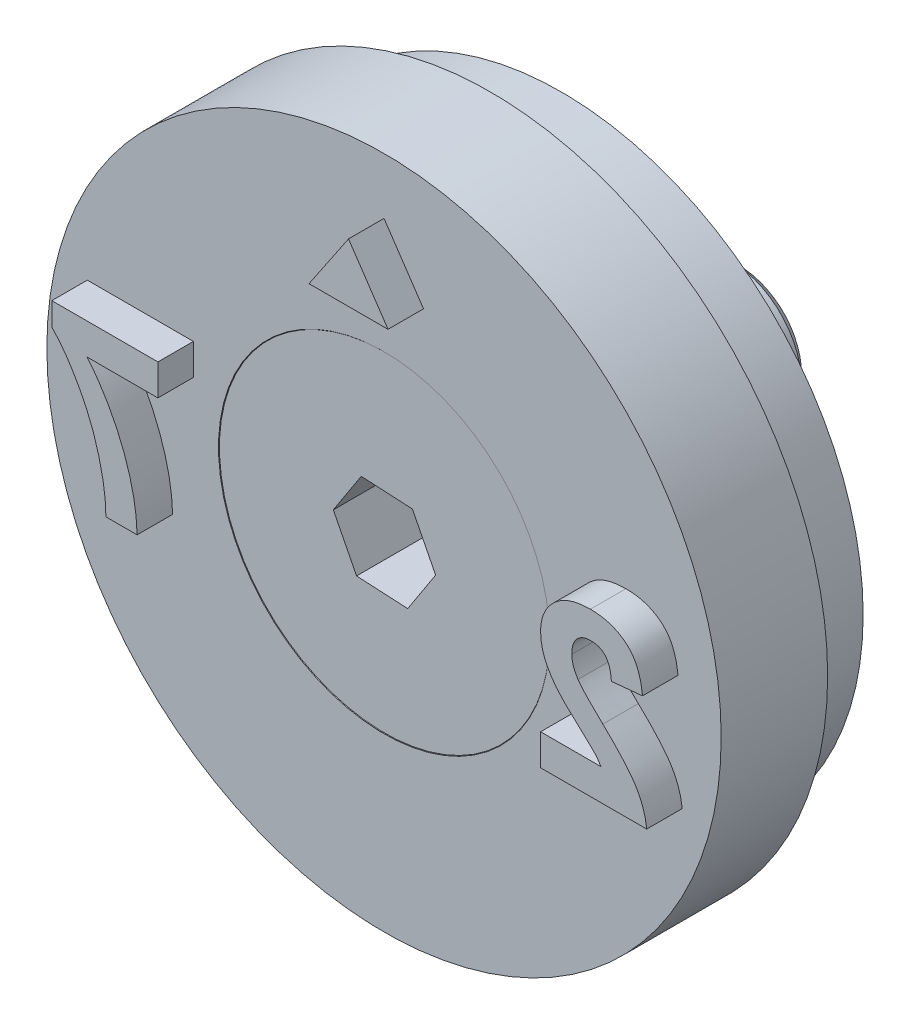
ISO-10303-21;
HEADER;
FILE_DESCRIPTION(('STEP AP214'),'2;1');
FILE_NAME('part.step','',(''),(''),'','','');
FILE_SCHEMA(('AUTOMOTIVE_DESIGN { 1 0 10303 214 1 1 1 1 }'));
ENDSEC;
DATA;
#1=APPLICATION_CONTEXT('core data for automotive mechanical design processes');
#2=APPLICATION_PROTOCOL_DEFINITION('international standard','automotive_design',2000,#1);
#3=PRODUCT_CONTEXT('',#1,'mechanical');
#4=PRODUCT('Part','Part','',(#3));
#5=PRODUCT_RELATED_PRODUCT_CATEGORY('part','',(#4));
#6=PRODUCT_DEFINITION_FORMATION('','',#4);
#7=PRODUCT_DEFINITION_CONTEXT('part definition',#1,'design');
#8=PRODUCT_DEFINITION('design','',#6,#7);
#9=PRODUCT_DEFINITION_SHAPE('','',#8);
#10=(LENGTH_UNIT() NAMED_UNIT(*) SI_UNIT(.MILLI.,.METRE.));
#11=(NAMED_UNIT(*) PLANE_ANGLE_UNIT() SI_UNIT($,.RADIAN.));
#12=(NAMED_UNIT(*) SI_UNIT($,.STERADIAN.) SOLID_ANGLE_UNIT());
#13=UNCERTAINTY_MEASURE_WITH_UNIT(LENGTH_MEASURE(1.E-05),#10,'distance_accuracy_value','');
#14=(GEOMETRIC_REPRESENTATION_CONTEXT(3) GLOBAL_UNCERTAINTY_ASSIGNED_CONTEXT((#13)) GLOBAL_UNIT_ASSIGNED_CONTEXT((#10,
#11,#12)) REPRESENTATION_CONTEXT('',''));
#15=CARTESIAN_POINT('',(0.,0.,0.));
#16=DIRECTION('',(0.,0.,1.));
#17=DIRECTION('',(1.,0.,0.));
#18=AXIS2_PLACEMENT_3D('',#15,#16,#17);
#19=CARTESIAN_POINT('',(0.,0.,-0.0130000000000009));
#20=DIRECTION('',(0.,0.,1.));
#21=DIRECTION('',(1.,0.,0.));
#22=AXIS2_PLACEMENT_3D('',#19,#20,#21);
#23=CYLINDRICAL_SURFACE('',#22,2.);
#24=CARTESIAN_POINT('',(0.,0.,-2.663));
#25=DIRECTION('',(0.,0.,1.));
#26=DIRECTION('',(1.,0.,0.));
#27=AXIS2_PLACEMENT_3D('',#24,#25,#26);
#28=CIRCLE('',#27,2.);
#29=CARTESIAN_POINT('',(2.,0.,-2.663));
#30=VERTEX_POINT('',#29);
#31=EDGE_CURVE('E12',#30,#30,#28,.T.);
#32=ORIENTED_EDGE('',*,*,#31,.F.);
#33=EDGE_LOOP('',(#32));
#34=FACE_BOUND('',#33,.T.);
#35=CARTESIAN_POINT('',(0.,0.,-9.763));
#36=DIRECTION('',(0.,0.,1.));
#37=DIRECTION('',(1.,0.,0.));
#38=AXIS2_PLACEMENT_3D('',#35,#36,#37);
#39=CIRCLE('',#38,2.);
#40=CARTESIAN_POINT('',(2.,0.,-9.763));
#41=VERTEX_POINT('',#40);
#42=EDGE_CURVE('E150',#41,#41,#39,.T.);
#43=ORIENTED_EDGE('',*,*,#42,.T.);
#44=EDGE_LOOP('',(#43));
#45=FACE_BOUND('',#44,.T.);
#46=ADVANCED_FACE('F49',(#34,#45),#23,.T.);
#47=CARTESIAN_POINT('',(0.,0.,-2.663));
#48=DIRECTION('',(0.,0.,1.));
#49=DIRECTION('',(1.,0.,0.));
#50=AXIS2_PLACEMENT_3D('',#47,#48,#49);
#51=CONICAL_SURFACE('',#50,2.,0.785398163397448);
#52=CARTESIAN_POINT('',(0.,0.,-0.0130000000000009));
#53=DIRECTION('',(0.,0.,1.));
#54=DIRECTION('',(1.,0.,0.));
#55=AXIS2_PLACEMENT_3D('',#52,#53,#54);
#56=CIRCLE('',#55,4.65);
#57=CARTESIAN_POINT('',(4.65,0.,-0.0130000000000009));
#58=VERTEX_POINT('',#57);
#59=EDGE_CURVE('E56',#58,#58,#56,.T.);
#60=ORIENTED_EDGE('',*,*,#59,.F.);
#61=EDGE_LOOP('',(#60));
#62=FACE_BOUND('',#61,.T.);
#63=ORIENTED_EDGE('',*,*,#31,.T.);
#64=EDGE_LOOP('',(#63));
#65=FACE_BOUND('',#64,.T.);
#66=ADVANCED_FACE('F165',(#62,#65),#51,.T.);
#67=CARTESIAN_POINT('',(0.,4.65,-0.0130000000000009));
#68=DIRECTION('',(0.,0.,-1.));
#69=DIRECTION('',(-1.,0.,0.));
#70=AXIS2_PLACEMENT_3D('',#67,#68,#69);
#71=PLANE('',#70);
#72=DIRECTION('',(0.99860351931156,-0.0528300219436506,0.));
#73=VECTOR('',#72,1.);
#74=CARTESIAN_POINT('',(-0.786717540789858,-1.21012761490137,-0.0130000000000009));
#75=LINE('',#74,#73);
#76=CARTESIAN_POINT('',(-0.786717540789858,-1.21012761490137,-0.0130000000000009));
#77=VERTEX_POINT('',#76);
#78=CARTESIAN_POINT('',(0.654642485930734,-1.28638118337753,-0.0130000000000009));
#79=VERTEX_POINT('',#78);
#80=EDGE_CURVE('E137',#77,#79,#75,.T.);
#81=ORIENTED_EDGE('',*,*,#80,.F.);
#82=DIRECTION('',(0.453549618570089,-0.891231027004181,0.));
#83=VECTOR('',#82,1.);
#84=CARTESIAN_POINT('',(-1.44136002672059,0.0762535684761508,-0.0130000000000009));
#85=LINE('',#84,#83);
#86=CARTESIAN_POINT('',(-1.44136002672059,0.0762535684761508,-0.0130000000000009));
#87=VERTEX_POINT('',#86);
#88=EDGE_CURVE('E63',#87,#77,#85,.T.);
#89=ORIENTED_EDGE('',*,*,#88,.F.);
#90=DIRECTION('',(-0.545053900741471,-0.83840100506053,0.));
#91=VECTOR('',#90,1.);
#92=CARTESIAN_POINT('',(-0.654642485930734,1.28638118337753,-0.0130000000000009));
#93=LINE('',#92,#91);
#94=CARTESIAN_POINT('',(-0.654642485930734,1.28638118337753,-0.0130000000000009));
#95=VERTEX_POINT('',#94);
#96=EDGE_CURVE('E146',#95,#87,#93,.T.);
#97=ORIENTED_EDGE('',*,*,#96,.F.);
#98=DIRECTION('',(-0.99860351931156,0.0528300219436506,0.));
#99=VECTOR('',#98,1.);
#100=CARTESIAN_POINT('',(0.786717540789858,1.21012761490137,-0.0130000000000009));
#101=LINE('',#100,#99);
#102=CARTESIAN_POINT('',(0.786717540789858,1.21012761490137,-0.0130000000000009));
#103=VERTEX_POINT('',#102);
#104=EDGE_CURVE('E144',#103,#95,#101,.T.);
#105=ORIENTED_EDGE('',*,*,#104,.F.);
#106=DIRECTION('',(-0.45354961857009,0.891231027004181,0.));
#107=VECTOR('',#106,1.);
#108=CARTESIAN_POINT('',(1.44136002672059,-0.0762535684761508,-0.0130000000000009));
#109=LINE('',#108,#107);
#110=CARTESIAN_POINT('',(1.44136002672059,-0.0762535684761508,-0.0130000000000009));
#111=VERTEX_POINT('',#110);
#112=EDGE_CURVE('E111',#111,#103,#109,.T.);
#113=ORIENTED_EDGE('',*,*,#112,.F.);
#114=DIRECTION('',(0.545053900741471,0.83840100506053,0.));
#115=VECTOR('',#114,1.);
#116=CARTESIAN_POINT('',(0.654642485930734,-1.28638118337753,-0.0130000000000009));
#117=LINE('',#116,#115);
#118=EDGE_CURVE('E140',#79,#111,#117,.T.);
#119=ORIENTED_EDGE('',*,*,#118,.F.);
#120=EDGE_LOOP('',(#81,#89,#97,#105,#113,#119));
#121=FACE_BOUND('',#120,.T.);
#122=ORIENTED_EDGE('',*,*,#59,.T.);
#123=EDGE_LOOP('',(#122));
#124=FACE_BOUND('',#123,.T.);
#125=ADVANCED_FACE('F163',(#121,#124),#71,.F.);
#126=CARTESIAN_POINT('',(0.,0.,-10.013));
#127=DIRECTION('',(0.,0.,1.));
#128=DIRECTION('',(1.,0.,0.));
#129=AXIS2_PLACEMENT_3D('',#126,#127,#128);
#130=PLANE('',#129);
#131=CARTESIAN_POINT('',(0.,0.,-10.013));
#132=DIRECTION('',(0.,0.,1.));
#133=DIRECTION('',(1.,0.,0.));
#134=AXIS2_PLACEMENT_3D('',#131,#132,#133);
#135=CIRCLE('',#134,1.75);
#136=CARTESIAN_POINT('',(1.75,0.,-10.013));
#137=VERTEX_POINT('',#136);
#138=EDGE_CURVE('E158',#137,#137,#135,.T.);
#139=ORIENTED_EDGE('',*,*,#138,.F.);
#140=EDGE_LOOP('',(#139));
#141=FACE_BOUND('',#140,.T.);
#142=ADVANCED_FACE('F178',(#141),#130,.F.);
#143=CARTESIAN_POINT('',(0.,0.,-10.013));
#144=DIRECTION('',(0.,0.,1.));
#145=DIRECTION('',(1.,0.,0.));
#146=AXIS2_PLACEMENT_3D('',#143,#144,#145);
#147=CONICAL_SURFACE('',#146,1.75,0.78539816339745);
#148=ORIENTED_EDGE('',*,*,#42,.F.);
#149=EDGE_LOOP('',(#148));
#150=FACE_BOUND('',#149,.T.);
#151=ORIENTED_EDGE('',*,*,#138,.T.);
#152=EDGE_LOOP('',(#151));
#153=FACE_BOUND('',#152,.T.);
#154=ADVANCED_FACE('F174',(#150,#153),#147,.T.);
#155=CARTESIAN_POINT('',(-1.44136002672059,0.0762535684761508,-2.013));
#156=DIRECTION('',(-0.891231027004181,-0.453549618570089,0.));
#157=DIRECTION('',(0.453549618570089,-0.891231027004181,0.));
#158=AXIS2_PLACEMENT_3D('',#155,#156,#157);
#159=PLANE('',#158);
#160=ORIENTED_EDGE('',*,*,#88,.T.);
#161=DIRECTION('',(0.,0.,1.));
#162=VECTOR('',#161,1.);
#163=CARTESIAN_POINT('',(-0.786717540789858,-1.21012761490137,-2.013));
#164=LINE('',#163,#162);
#165=CARTESIAN_POINT('',(-0.786717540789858,-1.21012761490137,-2.013));
#166=VERTEX_POINT('',#165);
#167=EDGE_CURVE('E93',#166,#77,#164,.T.);
#168=ORIENTED_EDGE('',*,*,#167,.F.);
#169=DIRECTION('',(0.453549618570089,-0.891231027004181,0.));
#170=VECTOR('',#169,1.);
#171=CARTESIAN_POINT('',(-1.44136002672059,0.0762535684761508,-2.013));
#172=LINE('',#171,#170);
#173=CARTESIAN_POINT('',(-1.44136002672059,0.0762535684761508,-2.013));
#174=VERTEX_POINT('',#173);
#175=EDGE_CURVE('E148',#174,#166,#172,.T.);
#176=ORIENTED_EDGE('',*,*,#175,.F.);
#177=DIRECTION('',(0.,0.,1.));
#178=VECTOR('',#177,1.);
#179=CARTESIAN_POINT('',(-1.44136002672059,0.0762535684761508,-2.013));
#180=LINE('',#179,#178);
#181=EDGE_CURVE('E71',#174,#87,#180,.T.);
#182=ORIENTED_EDGE('',*,*,#181,.T.);
#183=EDGE_LOOP('',(#160,#168,#176,#182));
#184=FACE_BOUND('',#183,.T.);
#185=ADVANCED_FACE('F177',(#184),#159,.F.);
#186=CARTESIAN_POINT('',(-0.654642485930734,1.28638118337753,-2.013));
#187=DIRECTION('',(-0.83840100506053,0.545053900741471,0.));
#188=DIRECTION('',(-0.54505390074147,-0.83840100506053,0.));
#189=AXIS2_PLACEMENT_3D('',#186,#187,#188);
#190=PLANE('',#189);
#191=ORIENTED_EDGE('',*,*,#96,.T.);
#192=ORIENTED_EDGE('',*,*,#181,.F.);
#193=DIRECTION('',(-0.545053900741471,-0.83840100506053,0.));
#194=VECTOR('',#193,1.);
#195=CARTESIAN_POINT('',(-0.654642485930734,1.28638118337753,-2.013));
#196=LINE('',#195,#194);
#197=CARTESIAN_POINT('',(-0.654642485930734,1.28638118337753,-2.013));
#198=VERTEX_POINT('',#197);
#199=EDGE_CURVE('E123',#198,#174,#196,.T.);
#200=ORIENTED_EDGE('',*,*,#199,.F.);
#201=DIRECTION('',(0.,0.,1.));
#202=VECTOR('',#201,1.);
#203=CARTESIAN_POINT('',(-0.654642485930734,1.28638118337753,-2.013));
#204=LINE('',#203,#202);
#205=EDGE_CURVE('E115',#198,#95,#204,.T.);
#206=ORIENTED_EDGE('',*,*,#205,.T.);
#207=EDGE_LOOP('',(#191,#192,#200,#206));
#208=FACE_BOUND('',#207,.T.);
#209=ADVANCED_FACE('F192',(#208),#190,.F.);
#210=CARTESIAN_POINT('',(0.786717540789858,1.21012761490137,-2.013));
#211=DIRECTION('',(0.0528300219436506,0.99860351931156,0.));
#212=DIRECTION('',(-0.99860351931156,0.0528300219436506,0.));
#213=AXIS2_PLACEMENT_3D('',#210,#211,#212);
#214=PLANE('',#213);
#215=ORIENTED_EDGE('',*,*,#104,.T.);
#216=ORIENTED_EDGE('',*,*,#205,.F.);
#217=DIRECTION('',(-0.99860351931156,0.0528300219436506,0.));
#218=VECTOR('',#217,1.);
#219=CARTESIAN_POINT('',(0.786717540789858,1.21012761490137,-2.013));
#220=LINE('',#219,#218);
#221=CARTESIAN_POINT('',(0.786717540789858,1.21012761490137,-2.013));
#222=VERTEX_POINT('',#221);
#223=EDGE_CURVE('E119',#222,#198,#220,.T.);
#224=ORIENTED_EDGE('',*,*,#223,.F.);
#225=DIRECTION('',(0.,0.,1.));
#226=VECTOR('',#225,1.);
#227=CARTESIAN_POINT('',(0.786717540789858,1.21012761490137,-2.013));
#228=LINE('',#227,#226);
#229=EDGE_CURVE('E104',#222,#103,#228,.T.);
#230=ORIENTED_EDGE('',*,*,#229,.T.);
#231=EDGE_LOOP('',(#215,#216,#224,#230));
#232=FACE_BOUND('',#231,.T.);
#233=ADVANCED_FACE('F120',(#232),#214,.F.);
#234=CARTESIAN_POINT('',(1.44136002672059,-0.0762535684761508,-2.013));
#235=DIRECTION('',(0.89123102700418,0.45354961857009,0.));
#236=DIRECTION('',(-0.45354961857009,0.891231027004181,0.));
#237=AXIS2_PLACEMENT_3D('',#234,#235,#236);
#238=PLANE('',#237);
#239=ORIENTED_EDGE('',*,*,#112,.T.);
#240=ORIENTED_EDGE('',*,*,#229,.F.);
#241=DIRECTION('',(-0.45354961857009,0.891231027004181,0.));
#242=VECTOR('',#241,1.);
#243=CARTESIAN_POINT('',(1.44136002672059,-0.0762535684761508,-2.013));
#244=LINE('',#243,#242);
#245=CARTESIAN_POINT('',(1.44136002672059,-0.0762535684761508,-2.013));
#246=VERTEX_POINT('',#245);
#247=EDGE_CURVE('E108',#246,#222,#244,.T.);
#248=ORIENTED_EDGE('',*,*,#247,.F.);
#249=DIRECTION('',(0.,0.,1.));
#250=VECTOR('',#249,1.);
#251=CARTESIAN_POINT('',(1.44136002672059,-0.0762535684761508,-2.013));
#252=LINE('',#251,#250);
#253=EDGE_CURVE('E116',#246,#111,#252,.T.);
#254=ORIENTED_EDGE('',*,*,#253,.T.);
#255=EDGE_LOOP('',(#239,#240,#248,#254));
#256=FACE_BOUND('',#255,.T.);
#257=ADVANCED_FACE('F106',(#256),#238,.F.);
#258=CARTESIAN_POINT('',(0.654642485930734,-1.28638118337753,-2.013));
#259=DIRECTION('',(0.83840100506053,-0.545053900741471,0.));
#260=DIRECTION('',(0.54505390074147,0.83840100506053,0.));
#261=AXIS2_PLACEMENT_3D('',#258,#259,#260);
#262=PLANE('',#261);
#263=ORIENTED_EDGE('',*,*,#118,.T.);
#264=ORIENTED_EDGE('',*,*,#253,.F.);
#265=DIRECTION('',(0.545053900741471,0.83840100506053,0.));
#266=VECTOR('',#265,1.);
#267=CARTESIAN_POINT('',(0.654642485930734,-1.28638118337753,-2.013));
#268=LINE('',#267,#266);
#269=CARTESIAN_POINT('',(0.654642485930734,-1.28638118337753,-2.013));
#270=VERTEX_POINT('',#269);
#271=EDGE_CURVE('E129',#270,#246,#268,.T.);
#272=ORIENTED_EDGE('',*,*,#271,.F.);
#273=DIRECTION('',(0.,0.,1.));
#274=VECTOR('',#273,1.);
#275=CARTESIAN_POINT('',(0.654642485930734,-1.28638118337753,-2.013));
#276=LINE('',#275,#274);
#277=EDGE_CURVE('E153',#270,#79,#276,.T.);
#278=ORIENTED_EDGE('',*,*,#277,.T.);
#279=EDGE_LOOP('',(#263,#264,#272,#278));
#280=FACE_BOUND('',#279,.T.);
#281=ADVANCED_FACE('F196',(#280),#262,.F.);
#282=CARTESIAN_POINT('',(-0.786717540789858,-1.21012761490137,-2.013));
#283=DIRECTION('',(-0.0528300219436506,-0.99860351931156,0.));
#284=DIRECTION('',(0.99860351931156,-0.0528300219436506,0.));
#285=AXIS2_PLACEMENT_3D('',#282,#283,#284);
#286=PLANE('',#285);
#287=ORIENTED_EDGE('',*,*,#80,.T.);
#288=ORIENTED_EDGE('',*,*,#277,.F.);
#289=DIRECTION('',(0.99860351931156,-0.0528300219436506,0.));
#290=VECTOR('',#289,1.);
#291=CARTESIAN_POINT('',(-0.786717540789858,-1.21012761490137,-2.013));
#292=LINE('',#291,#290);
#293=EDGE_CURVE('E131',#166,#270,#292,.T.);
#294=ORIENTED_EDGE('',*,*,#293,.F.);
#295=ORIENTED_EDGE('',*,*,#167,.T.);
#296=EDGE_LOOP('',(#287,#288,#294,#295));
#297=FACE_BOUND('',#296,.T.);
#298=ADVANCED_FACE('F193',(#297),#286,.F.);
#299=CARTESIAN_POINT('',(0.,0.,-2.013));
#300=DIRECTION('',(0.,0.,1.));
#301=DIRECTION('',(1.,0.,0.));
#302=AXIS2_PLACEMENT_3D('',#299,#300,#301);
#303=PLANE('',#302);
#304=ORIENTED_EDGE('',*,*,#175,.T.);
#305=ORIENTED_EDGE('',*,*,#293,.T.);
#306=ORIENTED_EDGE('',*,*,#271,.T.);
#307=ORIENTED_EDGE('',*,*,#247,.T.);
#308=ORIENTED_EDGE('',*,*,#223,.T.);
#309=ORIENTED_EDGE('',*,*,#199,.T.);
#310=EDGE_LOOP('',(#304,#305,#306,#307,#308,#309));
#311=FACE_BOUND('',#310,.T.);
#312=ADVANCED_FACE('F126',(#311),#303,.T.);
#313=CLOSED_SHELL('',(#46,#66,#125,#142,#154,#185,#209,#233,#257,#281,#298,#312));
#314=MANIFOLD_SOLID_BREP('B2',#313);
#315=CARTESIAN_POINT('',(0.,9.5,0.));
#316=DIRECTION('',(0.,0.,-1.));
#317=DIRECTION('',(-1.,0.,0.));
#318=AXIS2_PLACEMENT_3D('',#315,#316,#317);
#319=PLANE('',#318);
#320=DIRECTION('',(1.,0.,0.));
#321=VECTOR('',#320,1.);
#322=CARTESIAN_POINT('',(-7.36433346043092,1.34815384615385,0.));
#323=LINE('',#322,#321);
#324=CARTESIAN_POINT('',(-7.36433346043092,1.34815384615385,0.));
#325=VERTEX_POINT('',#324);
#326=CARTESIAN_POINT('',(-5.37049451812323,1.34815384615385,0.));
#327=VERTEX_POINT('',#326);
#328=EDGE_CURVE('E482',#325,#327,#323,.T.);
#329=ORIENTED_EDGE('',*,*,#328,.F.);
#330=CARTESIAN_POINT('',(-5.95664836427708,-2.286,0.));
#331=CARTESIAN_POINT('',(-5.9595883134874,-2.20811047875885,0.));
#332=CARTESIAN_POINT('',(-5.96550087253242,-2.05146614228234,0.));
#333=CARTESIAN_POINT('',(-5.98762241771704,-1.81634810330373,0.));
#334=CARTESIAN_POINT('',(-6.02236668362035,-1.58035458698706,0.));
#335=CARTESIAN_POINT('',(-6.06552139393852,-1.34294016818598,0.));
#336=CARTESIAN_POINT('',(-6.12249636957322,-1.10468282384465,0.));
#337=CARTESIAN_POINT('',(-6.1875222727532,-0.864699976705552,0.));
#338=CARTESIAN_POINT('',(-6.26629137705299,-0.624273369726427,0.));
#339=CARTESIAN_POINT('',(-6.35458942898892,-0.383862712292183,0.));
#340=CARTESIAN_POINT('',(-6.45206583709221,-0.145750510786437,0.));
#341=CARTESIAN_POINT('',(-6.55830140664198,0.0871098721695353,0.));
#342=CARTESIAN_POINT('',(-6.67302150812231,0.313265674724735,0.));
#343=CARTESIAN_POINT('',(-6.79473422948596,0.533511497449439,0.));
#344=CARTESIAN_POINT('',(-6.92485552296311,0.747138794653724,0.));
#345=CARTESIAN_POINT('',(-7.06348335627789,0.953915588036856,0.));
#346=CARTESIAN_POINT('',(-7.20865132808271,1.15533763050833,0.));
#347=CARTESIAN_POINT('',(-7.31244815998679,1.28389260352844,0.));
#348=CARTESIAN_POINT('',(-7.36433346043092,1.34815384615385,0.));
#349=B_SPLINE_CURVE_WITH_KNOTS('',3,(#330,#331,#332,#333,#334,#335,#336,#337,#338,#339,#340,
#341,#342,#343,#344,#345,#346,#347,#348),.UNSPECIFIED.,.F.,.F.,(4,1,1,1,1,1,1,1,1,1,1,1,1,1,1,1,
4),(0.,0.0589531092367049,0.118561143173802,0.178522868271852,0.239353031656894,
0.301026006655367,0.363773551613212,0.427382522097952,0.492333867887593,0.557475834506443,
0.621960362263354,0.685889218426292,0.749254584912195,0.812267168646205,0.875035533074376,
0.937533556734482,1.),.UNSPECIFIED.);
#350=CARTESIAN_POINT('',(-5.95664836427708,-2.286,0.));
#351=VERTEX_POINT('',#350);
#352=EDGE_CURVE('E495',#351,#325,#349,.T.);
#353=ORIENTED_EDGE('',*,*,#352,.F.);
#354=DIRECTION('',(1.,0.,0.));
#355=VECTOR('',#354,1.);
#356=CARTESIAN_POINT('',(-6.83587913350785,-2.286,0.));
#357=LINE('',#356,#355);
#358=CARTESIAN_POINT('',(-6.83587913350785,-2.286,0.));
#359=VERTEX_POINT('',#358);
#360=EDGE_CURVE('E752',#359,#351,#357,.T.);
#361=ORIENTED_EDGE('',*,*,#360,.F.);
#362=CARTESIAN_POINT('',(-8.35987913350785,1.58261538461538,0.));
#363=CARTESIAN_POINT('',(-8.3286942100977,1.55088574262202,0.));
#364=CARTESIAN_POINT('',(-8.26458696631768,1.48565871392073,0.));
#365=CARTESIAN_POINT('',(-8.17275960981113,1.37890819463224,0.));
#366=CARTESIAN_POINT('',(-8.07957170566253,1.26306514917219,0.));
#367=CARTESIAN_POINT('',(-7.9869719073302,1.13656859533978,0.));
#368=CARTESIAN_POINT('',(-7.89208179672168,1.00141676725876,0.));
#369=CARTESIAN_POINT('',(-7.7990714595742,0.855018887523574,0.));
#370=CARTESIAN_POINT('',(-7.70473816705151,0.699274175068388,0.));
#371=CARTESIAN_POINT('',(-7.57773573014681,0.47897296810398,0.));
#372=CARTESIAN_POINT('',(-7.42928572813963,0.19119152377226,0.));
#373=CARTESIAN_POINT('',(-7.27223347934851,-0.166535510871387,0.));
#374=CARTESIAN_POINT('',(-7.13843215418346,-0.535248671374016,0.));
#375=CARTESIAN_POINT('',(-7.04681088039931,-0.84941946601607,0.));
#376=CARTESIAN_POINT('',(-6.98490596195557,-1.1012268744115,0.));
#377=CARTESIAN_POINT('',(-6.94446028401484,-1.28535441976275,0.));
#378=CARTESIAN_POINT('',(-6.91041360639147,-1.46430037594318,0.));
#379=CARTESIAN_POINT('',(-6.88271665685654,-1.63837923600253,0.));
#380=CARTESIAN_POINT('',(-6.86204564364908,-1.80767041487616,0.));
#381=CARTESIAN_POINT('',(-6.84571201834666,-1.97158534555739,0.));
#382=CARTESIAN_POINT('',(-6.83765369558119,-2.13052373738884,0.));
#383=CARTESIAN_POINT('',(-6.83646460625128,-2.23470446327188,0.));
#384=CARTESIAN_POINT('',(-6.83587913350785,-2.286,0.));
#385=B_SPLINE_CURVE_WITH_KNOTS('',3,(#362,#363,#364,#365,#366,#367,#368,#369,#370,#371,#372,
#373,#374,#375,#376,#377,#378,#379,#380,#381,#382,#383,#384),.UNSPECIFIED.,.F.,.F.,(4,1,1,1,1,1,
1,1,1,1,1,1,1,1,1,1,1,1,1,1,4),(0.,0.0314272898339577,0.0646054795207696,0.0994393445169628,
0.136456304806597,0.175351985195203,0.216100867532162,0.258977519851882,0.304007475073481,
0.395756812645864,0.487615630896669,0.579873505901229,0.672707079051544,0.718694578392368,
0.76307923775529,0.80589344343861,0.847386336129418,0.88760014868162,0.926386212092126,
0.963754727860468,1.),.UNSPECIFIED.);
#386=CARTESIAN_POINT('',(-8.35987913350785,1.58261538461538,0.));
#387=VERTEX_POINT('',#386);
#388=EDGE_CURVE('E747',#387,#359,#385,.T.);
#389=ORIENTED_EDGE('',*,*,#388,.F.);
#390=DIRECTION('',(0.,-1.,0.));
#391=VECTOR('',#390,1.);
#392=CARTESIAN_POINT('',(-8.35987913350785,2.22738461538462,0.));
#393=LINE('',#392,#391);
#394=CARTESIAN_POINT('',(-8.35987913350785,2.22738461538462,0.));
#395=VERTEX_POINT('',#394);
#396=EDGE_CURVE('E744',#395,#387,#393,.T.);
#397=ORIENTED_EDGE('',*,*,#396,.F.);
#398=DIRECTION('',(-1.,0.,0.));
#399=VECTOR('',#398,1.);
#400=CARTESIAN_POINT('',(-5.37049451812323,2.22738461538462,0.));
#401=LINE('',#400,#399);
#402=CARTESIAN_POINT('',(-5.37049451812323,2.22738461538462,0.));
#403=VERTEX_POINT('',#402);
#404=EDGE_CURVE('E741',#403,#395,#401,.T.);
#405=ORIENTED_EDGE('',*,*,#404,.F.);
#406=DIRECTION('',(0.,1.,0.));
#407=VECTOR('',#406,1.);
#408=CARTESIAN_POINT('',(-5.37049451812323,1.34815384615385,0.));
#409=LINE('',#408,#407);
#410=EDGE_CURVE('E485',#327,#403,#409,.T.);
#411=ORIENTED_EDGE('',*,*,#410,.F.);
#412=EDGE_LOOP('',(#329,#353,#361,#389,#397,#405,#411));
#413=FACE_BOUND('',#412,.T.);
#414=CARTESIAN_POINT('',(0.,0.,0.));
#415=DIRECTION('',(0.,0.,1.));
#416=DIRECTION('',(1.,0.,0.));
#417=AXIS2_PLACEMENT_3D('',#414,#415,#416);
#418=CIRCLE('',#417,9.5);
#419=CARTESIAN_POINT('',(9.5,0.,0.));
#420=VERTEX_POINT('',#419);
#421=EDGE_CURVE('E47',#420,#420,#418,.T.);
#422=ORIENTED_EDGE('',*,*,#421,.T.);
#423=EDGE_LOOP('',(#422));
#424=FACE_BOUND('',#423,.T.);
#425=CARTESIAN_POINT('',(0.,0.,0.));
#426=DIRECTION('',(0.,0.,1.));
#427=DIRECTION('',(1.,0.,0.));
#428=AXIS2_PLACEMENT_3D('',#425,#426,#427);
#429=CIRCLE('',#428,4.663);
#430=CARTESIAN_POINT('',(4.663,0.,0.));
#431=VERTEX_POINT('',#430);
#432=EDGE_CURVE('E317',#431,#431,#429,.T.);
#433=ORIENTED_EDGE('',*,*,#432,.F.);
#434=EDGE_LOOP('',(#433));
#435=FACE_BOUND('',#434,.T.);
#436=DIRECTION('',(-1.,0.,0.));
#437=VECTOR('',#436,1.);
#438=CARTESIAN_POINT('',(7.11132192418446,-1.40676923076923,0.));
#439=LINE('',#438,#437);
#440=CARTESIAN_POINT('',(7.11132192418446,-1.40676923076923,0.));
#441=VERTEX_POINT('',#440);
#442=CARTESIAN_POINT('',(5.41239163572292,-1.40676923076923,0.));
#443=VERTEX_POINT('',#442);
#444=EDGE_CURVE('E558',#441,#443,#439,.T.);
#445=ORIENTED_EDGE('',*,*,#444,.F.);
#446=CARTESIAN_POINT('',(5.85567048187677,-0.104408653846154,0.));
#447=CARTESIAN_POINT('',(5.86957664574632,-0.121923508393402,0.));
#448=CARTESIAN_POINT('',(5.89936042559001,-0.159436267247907,0.));
#449=CARTESIAN_POINT('',(5.95003046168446,-0.216956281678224,0.));
#450=CARTESIAN_POINT('',(6.00875267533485,-0.279786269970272,0.));
#451=CARTESIAN_POINT('',(6.07469764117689,-0.349102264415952,0.));
#452=CARTESIAN_POINT('',(6.15004365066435,-0.422449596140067,0.));
#453=CARTESIAN_POINT('',(6.2320797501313,-0.502895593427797,0.));
#454=CARTESIAN_POINT('',(6.32441576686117,-0.586325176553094,0.));
#455=CARTESIAN_POINT('',(6.42005350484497,-0.674819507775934,0.));
#456=CARTESIAN_POINT('',(6.51610694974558,-0.760949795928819,0.));
#457=CARTESIAN_POINT('',(6.60439391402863,-0.842754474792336,0.));
#458=CARTESIAN_POINT('',(6.68458785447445,-0.915134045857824,0.));
#459=CARTESIAN_POINT('',(6.75295398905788,-0.98208419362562,0.));
#460=CARTESIAN_POINT('',(6.81351359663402,-1.03903561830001,0.));
#461=CARTESIAN_POINT('',(6.86408390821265,-1.08890872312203,0.));
#462=CARTESIAN_POINT('',(6.9056112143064,-1.13049612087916,0.));
#463=CARTESIAN_POINT('',(6.96283316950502,-1.19532032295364,0.));
#464=CARTESIAN_POINT('',(7.03564161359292,-1.28299508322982,0.));
#465=CARTESIAN_POINT('',(7.08686533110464,-1.36677079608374,0.));
#466=CARTESIAN_POINT('',(7.11132192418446,-1.40676923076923,0.));
#467=B_SPLINE_CURVE_WITH_KNOTS('',3,(#446,#447,#448,#449,#450,#451,#452,#453,#454,#455,#456,
#457,#458,#459,#460,#461,#462,#463,#464,#465,#466),.UNSPECIFIED.,.F.,.F.,(4,1,1,1,1,1,1,1,1,1,1,
1,1,1,1,1,1,1,4),(0.,0.0369753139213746,0.0791925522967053,0.126700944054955,0.179184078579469,
0.237368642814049,0.300558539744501,0.369153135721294,0.443112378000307,0.516018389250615,
0.582473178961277,0.642136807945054,0.694619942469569,0.740679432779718,0.779589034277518,
0.812073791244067,0.837814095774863,0.922564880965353,1.),.UNSPECIFIED.);
#468=CARTESIAN_POINT('',(5.85567048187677,-0.104408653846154,0.));
#469=VERTEX_POINT('',#468);
#470=EDGE_CURVE('E635',#469,#441,#467,.T.);
#471=ORIENTED_EDGE('',*,*,#470,.F.);
#472=CARTESIAN_POINT('',(5.41239163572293,1.04225480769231,0.));
#473=CARTESIAN_POINT('',(5.41351022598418,0.992417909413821,0.));
#474=CARTESIAN_POINT('',(5.41572933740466,0.893549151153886,0.));
#475=CARTESIAN_POINT('',(5.43697568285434,0.74739158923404,0.));
#476=CARTESIAN_POINT('',(5.46943596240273,0.604604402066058,0.));
#477=CARTESIAN_POINT('',(5.5174096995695,0.4648386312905,0.));
#478=CARTESIAN_POINT('',(5.57822013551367,0.324741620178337,0.));
#479=CARTESIAN_POINT('',(5.65660624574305,0.183998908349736,0.));
#480=CARTESIAN_POINT('',(5.74761844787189,0.0383659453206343,0.));
#481=CARTESIAN_POINT('',(5.81887741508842,-0.0557921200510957,0.));
#482=CARTESIAN_POINT('',(5.85567048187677,-0.104408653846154,0.));
#483=B_SPLINE_CURVE_WITH_KNOTS('',3,(#472,#473,#474,#475,#476,#477,#478,#479,#480,#481,#482),
.UNSPECIFIED.,.F.,.F.,(4,1,1,1,1,1,1,1,4),(0.,0.119176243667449,0.236427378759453,
0.352663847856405,0.469086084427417,0.589462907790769,0.717601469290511,0.854189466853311,1.),.UNSPECIFIED.);
#484=CARTESIAN_POINT('',(5.41239163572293,1.04225480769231,0.));
#485=VERTEX_POINT('',#484);
#486=EDGE_CURVE('E627',#485,#469,#483,.T.);
#487=ORIENTED_EDGE('',*,*,#486,.F.);
#488=CARTESIAN_POINT('',(6.81549740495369,2.286,0.));
#489=CARTESIAN_POINT('',(6.76233788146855,2.28497830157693,0.));
#490=CARTESIAN_POINT('',(6.65880303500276,2.28298841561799,0.));
#491=CARTESIAN_POINT('',(6.50766053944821,2.26655592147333,0.));
#492=CARTESIAN_POINT('',(6.36567302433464,2.23790348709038,0.));
#493=CARTESIAN_POINT('',(6.23159913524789,2.19994928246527,0.));
#494=CARTESIAN_POINT('',(6.10681573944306,2.14927764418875,0.));
#495=CARTESIAN_POINT('',(5.99028302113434,2.08801774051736,0.));
#496=CARTESIAN_POINT('',(5.8838350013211,2.01384463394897,0.));
#497=CARTESIAN_POINT('',(5.78588492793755,1.93080329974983,0.));
#498=CARTESIAN_POINT('',(5.69832539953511,1.8394847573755,0.));
#499=CARTESIAN_POINT('',(5.62163117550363,1.74207809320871,0.));
#500=CARTESIAN_POINT('',(5.55737700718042,1.63865117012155,0.));
#501=CARTESIAN_POINT('',(5.50345789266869,1.53046464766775,0.));
#502=CARTESIAN_POINT('',(5.46342331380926,1.41577764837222,0.));
#503=CARTESIAN_POINT('',(5.43425237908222,1.29617597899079,0.));
#504=CARTESIAN_POINT('',(5.41491087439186,1.17110167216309,0.));
#505=CARTESIAN_POINT('',(5.4132406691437,1.0856787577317,0.));
#506=CARTESIAN_POINT('',(5.41239163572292,1.04225480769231,0.));
#507=B_SPLINE_CURVE_WITH_KNOTS('',3,(#488,#489,#490,#491,#492,#493,#494,#495,#496,#497,#498,
#499,#500,#501,#502,#503,#504,#505,#506),.UNSPECIFIED.,.F.,.F.,(4,1,1,1,1,1,1,1,1,1,1,1,1,1,1,1,
4),(0.,0.0756723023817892,0.147381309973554,0.216084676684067,0.281698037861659,
0.345459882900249,0.407485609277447,0.46873129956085,0.529782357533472,0.590032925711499,
0.648548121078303,0.70595351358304,0.763101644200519,0.820289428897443,0.878479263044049,
0.938226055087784,1.),.UNSPECIFIED.);
#508=CARTESIAN_POINT('',(6.81549740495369,2.286,0.));
#509=VERTEX_POINT('',#508);
#510=EDGE_CURVE('E619',#509,#485,#507,.T.);
#511=ORIENTED_EDGE('',*,*,#510,.F.);
#512=CARTESIAN_POINT('',(8.28454548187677,0.90670673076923,0.));
#513=CARTESIAN_POINT('',(8.2774766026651,0.966065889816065,0.));
#514=CARTESIAN_POINT('',(8.26377117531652,1.08115381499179,0.));
#515=CARTESIAN_POINT('',(8.2295690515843,1.24645975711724,0.));
#516=CARTESIAN_POINT('',(8.18625332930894,1.39896195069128,0.));
#517=CARTESIAN_POINT('',(8.131759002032,1.5383773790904,0.));
#518=CARTESIAN_POINT('',(8.06833838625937,1.66559258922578,0.));
#519=CARTESIAN_POINT('',(7.99275650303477,1.77869863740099,0.));
#520=CARTESIAN_POINT('',(7.90765426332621,1.8789484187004,0.));
#521=CARTESIAN_POINT('',(7.81295811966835,1.96628857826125,0.));
#522=CARTESIAN_POINT('',(7.70927008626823,2.04099696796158,0.));
#523=CARTESIAN_POINT('',(7.60046810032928,2.1076856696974,0.));
#524=CARTESIAN_POINT('',(7.48442586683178,2.1623916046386,0.));
#525=CARTESIAN_POINT('',(7.36242101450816,2.207477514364,0.));
#526=CARTESIAN_POINT('',(7.23450867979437,2.24350981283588,0.));
#527=CARTESIAN_POINT('',(7.10009725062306,2.2673338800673,0.));
#528=CARTESIAN_POINT('',(6.96001626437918,2.28409182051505,0.));
#529=CARTESIAN_POINT('',(6.86439639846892,2.2853543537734,0.));
#530=CARTESIAN_POINT('',(6.81549740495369,2.286,0.));
#531=B_SPLINE_CURVE_WITH_KNOTS('',3,(#512,#513,#514,#515,#516,#517,#518,#519,#520,#521,#522,
#523,#524,#525,#526,#527,#528,#529,#530),.UNSPECIFIED.,.F.,.F.,(4,1,1,1,1,1,1,1,1,1,1,1,1,1,1,1,
4),(0.,0.0794357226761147,0.154013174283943,0.224141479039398,0.289934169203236,
0.352732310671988,0.412725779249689,0.470302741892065,0.527168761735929,0.583502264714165,
0.639948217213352,0.696584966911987,0.753726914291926,0.812707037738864,0.872963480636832,
0.93503486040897,1.),.UNSPECIFIED.);
#532=CARTESIAN_POINT('',(8.28454548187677,0.90670673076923,0.));
#533=VERTEX_POINT('',#532);
#534=EDGE_CURVE('E614',#533,#509,#531,.T.);
#535=ORIENTED_EDGE('',*,*,#534,.F.);
#536=DIRECTION('',(0.995240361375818,0.0974506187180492,0.));
#537=VECTOR('',#536,1.);
#538=CARTESIAN_POINT('',(7.405314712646,0.820615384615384,0.));
#539=LINE('',#538,#537);
#540=CARTESIAN_POINT('',(7.405314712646,0.820615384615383,0.));
#541=VERTEX_POINT('',#540);
#542=EDGE_CURVE('E608',#541,#533,#539,.T.);
#543=ORIENTED_EDGE('',*,*,#542,.F.);
#544=CARTESIAN_POINT('',(6.833814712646,1.524,0.));
#545=CARTESIAN_POINT('',(6.87369278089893,1.52219327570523,0.));
#546=CARTESIAN_POINT('',(6.95072859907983,1.51870307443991,0.));
#547=CARTESIAN_POINT('',(7.06021321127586,1.48821315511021,0.));
#548=CARTESIAN_POINT('',(7.15599204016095,1.43543189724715,0.));
#549=CARTESIAN_POINT('',(7.22424912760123,1.37528256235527,0.));
#550=CARTESIAN_POINT('',(7.27036002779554,1.3167917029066,0.));
#551=CARTESIAN_POINT('',(7.30177838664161,1.26582077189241,0.));
#552=CARTESIAN_POINT('',(7.32885855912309,1.20790216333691,0.));
#553=CARTESIAN_POINT('',(7.35285385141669,1.14368794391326,0.));
#554=CARTESIAN_POINT('',(7.37180741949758,1.07244247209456,0.));
#555=CARTESIAN_POINT('',(7.38707144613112,0.994708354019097,0.));
#556=CARTESIAN_POINT('',(7.39937204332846,0.910067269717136,0.));
#557=CARTESIAN_POINT('',(7.40328385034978,0.851184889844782,0.));
#558=CARTESIAN_POINT('',(7.405314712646,0.820615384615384,0.));
#559=B_SPLINE_CURVE_WITH_KNOTS('',3,(#544,#545,#546,#547,#548,#549,#550,#551,#552,#553,#554,
#555,#556,#557,#558),.UNSPECIFIED.,.F.,.F.,(4,1,1,1,1,1,1,1,1,1,1,1,4),(0.,0.116899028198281,
0.225823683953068,0.330086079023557,0.43545148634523,0.490306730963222,0.548244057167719,
0.610766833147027,0.677675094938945,0.749188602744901,0.826858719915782,0.910111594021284,1.),.UNSPECIFIED.);
#560=CARTESIAN_POINT('',(6.833814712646,1.524,0.));
#561=VERTEX_POINT('',#560);
#562=EDGE_CURVE('E600',#561,#541,#559,.T.);
#563=ORIENTED_EDGE('',*,*,#562,.F.);
#564=CARTESIAN_POINT('',(6.29162240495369,0.924108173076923,0.));
#565=CARTESIAN_POINT('',(6.2932690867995,0.969724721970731,0.));
#566=CARTESIAN_POINT('',(6.29638448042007,1.05602767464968,0.));
#567=CARTESIAN_POINT('',(6.3225075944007,1.17781709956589,0.));
#568=CARTESIAN_POINT('',(6.3688326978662,1.28251236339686,0.));
#569=CARTESIAN_POINT('',(6.432613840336,1.3704348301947,0.));
#570=CARTESIAN_POINT('',(6.51326522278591,1.43932174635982,0.));
#571=CARTESIAN_POINT('',(6.60754903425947,1.49022249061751,0.));
#572=CARTESIAN_POINT('',(6.71684543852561,1.51836396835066,0.));
#573=CARTESIAN_POINT('',(6.79366539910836,1.52206545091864,0.));
#574=CARTESIAN_POINT('',(6.833814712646,1.524,0.));
#575=B_SPLINE_CURVE_WITH_KNOTS('',3,(#564,#565,#566,#567,#568,#569,#570,#571,#572,#573,#574),
.UNSPECIFIED.,.F.,.F.,(4,1,1,1,1,1,1,1,4),(0.,0.149140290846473,0.282161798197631,
0.404655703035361,0.521109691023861,0.634416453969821,0.748796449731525,0.868710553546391,1.),.UNSPECIFIED.);
#576=CARTESIAN_POINT('',(6.29162240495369,0.924108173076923,0.));
#577=VERTEX_POINT('',#576);
#578=EDGE_CURVE('E592',#577,#561,#575,.T.);
#579=ORIENTED_EDGE('',*,*,#578,.F.);
#580=CARTESIAN_POINT('',(6.46563682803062,0.395653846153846,0.));
#581=CARTESIAN_POINT('',(6.43916517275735,0.439626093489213,0.));
#582=CARTESIAN_POINT('',(6.38810441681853,0.524443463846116,0.));
#583=CARTESIAN_POINT('',(6.33211206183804,0.657820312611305,0.));
#584=CARTESIAN_POINT('',(6.29850336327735,0.791169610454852,0.));
#585=CARTESIAN_POINT('',(6.29389134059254,0.88027284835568,0.));
#586=CARTESIAN_POINT('',(6.29162240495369,0.924108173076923,0.));
#587=B_SPLINE_CURVE_WITH_KNOTS('',3,(#580,#581,#582,#583,#584,#585,#586),.UNSPECIFIED.,.F.,.F.,
(4,1,1,1,4),(0.,0.272795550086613,0.526191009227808,0.766904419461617,1.),.UNSPECIFIED.);
#588=CARTESIAN_POINT('',(6.46563682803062,0.395653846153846,0.));
#589=VERTEX_POINT('',#588);
#590=EDGE_CURVE('E584',#589,#577,#587,.T.);
#591=ORIENTED_EDGE('',*,*,#590,.F.);
#592=CARTESIAN_POINT('',(7.16535798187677,-0.342533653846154,0.));
#593=CARTESIAN_POINT('',(7.12015448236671,-0.298899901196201,0.));
#594=CARTESIAN_POINT('',(7.03410033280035,-0.215834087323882,0.));
#595=CARTESIAN_POINT('',(6.91155905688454,-0.0968872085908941,0.));
#596=CARTESIAN_POINT('',(6.80383264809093,0.012458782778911,0.));
#597=CARTESIAN_POINT('',(6.70866869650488,0.109370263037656,0.));
#598=CARTESIAN_POINT('',(6.62826562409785,0.196314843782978,0.));
#599=CARTESIAN_POINT('',(6.56156580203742,0.271927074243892,0.));
#600=CARTESIAN_POINT('',(6.50772448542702,0.33651487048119,0.));
#601=CARTESIAN_POINT('',(6.47856398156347,0.377489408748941,0.));
#602=CARTESIAN_POINT('',(6.46563682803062,0.395653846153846,0.));
#603=B_SPLINE_CURVE_WITH_KNOTS('',3,(#592,#593,#594,#595,#596,#597,#598,#599,#600,#601,#602),
.UNSPECIFIED.,.F.,.F.,(4,1,1,1,1,1,1,1,4),(0.,0.185090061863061,0.352356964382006,
0.503079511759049,0.637279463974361,0.752473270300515,0.851885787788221,0.934339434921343,1.),.UNSPECIFIED.);
#604=CARTESIAN_POINT('',(7.16535798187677,-0.342533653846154,0.));
#605=VERTEX_POINT('',#604);
#606=EDGE_CURVE('E576',#605,#589,#603,.T.);
#607=ORIENTED_EDGE('',*,*,#606,.F.);
#608=CARTESIAN_POINT('',(8.40177625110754,-2.286,0.));
#609=CARTESIAN_POINT('',(8.39165488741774,-2.21085697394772,0.));
#610=CARTESIAN_POINT('',(8.37141783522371,-2.06061305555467,0.));
#611=CARTESIAN_POINT('',(8.30885210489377,-1.84114450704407,0.));
#612=CARTESIAN_POINT('',(8.22534828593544,-1.62698070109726,0.));
#613=CARTESIAN_POINT('',(8.13472075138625,-1.45270334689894,0.));
#614=CARTESIAN_POINT('',(8.04458162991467,-1.31241607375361,0.));
#615=CARTESIAN_POINT('',(7.96279839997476,-1.19746359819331,0.));
#616=CARTESIAN_POINT('',(7.86523400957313,-1.07515909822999,0.));
#617=CARTESIAN_POINT('',(7.75330422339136,-0.944515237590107,0.));
#618=CARTESIAN_POINT('',(7.62762761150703,-0.805123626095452,0.));
#619=CARTESIAN_POINT('',(7.48726654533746,-0.657502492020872,0.));
#620=CARTESIAN_POINT('',(7.33155148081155,-0.502358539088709,0.));
#621=CARTESIAN_POINT('',(7.22200315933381,-0.397008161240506,0.));
#622=CARTESIAN_POINT('',(7.16535798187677,-0.342533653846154,0.));
#623=B_SPLINE_CURVE_WITH_KNOTS('',3,(#608,#609,#610,#611,#612,#613,#614,#615,#616,#617,#618,
#619,#620,#621,#622),.UNSPECIFIED.,.F.,.F.,(4,1,1,1,1,1,1,1,1,1,1,1,4),(0.,0.0963574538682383,
0.192660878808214,0.289454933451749,0.388479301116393,0.441921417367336,0.501521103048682,
0.567882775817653,0.640891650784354,0.720370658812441,0.806636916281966,0.900015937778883,1.),.UNSPECIFIED.);
#624=CARTESIAN_POINT('',(8.40177625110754,-2.286,0.));
#625=VERTEX_POINT('',#624);
#626=EDGE_CURVE('E571',#625,#605,#623,.T.);
#627=ORIENTED_EDGE('',*,*,#626,.F.);
#628=DIRECTION('',(1.,0.,0.));
#629=VECTOR('',#628,1.);
#630=CARTESIAN_POINT('',(5.41239163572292,-2.286,0.));
#631=LINE('',#630,#629);
#632=CARTESIAN_POINT('',(5.41239163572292,-2.286,0.));
#633=VERTEX_POINT('',#632);
#634=EDGE_CURVE('E568',#633,#625,#631,.T.);
#635=ORIENTED_EDGE('',*,*,#634,.F.);
#636=DIRECTION('',(0.,-1.,0.));
#637=VECTOR('',#636,1.);
#638=CARTESIAN_POINT('',(5.41239163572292,-1.40676923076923,0.));
#639=LINE('',#638,#637);
#640=EDGE_CURVE('E564',#443,#633,#639,.T.);
#641=ORIENTED_EDGE('',*,*,#640,.F.);
#642=EDGE_LOOP('',(#445,#471,#487,#511,#535,#543,#563,#579,#591,#607,#627,#635,#641));
#643=FACE_BOUND('',#642,.T.);
#644=DIRECTION('',(-0.559192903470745,0.829037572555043,0.));
#645=VECTOR('',#644,1.);
#646=CARTESIAN_POINT('',(1.11293905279,6.264516,0.));
#647=LINE('',#646,#645);
#648=CARTESIAN_POINT('',(1.11293905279,6.264516,0.));
#649=VERTEX_POINT('',#648);
#650=CARTESIAN_POINT('',(0.,7.914516,0.));
#651=VERTEX_POINT('',#650);
#652=EDGE_CURVE('E481',#649,#651,#647,.T.);
#653=ORIENTED_EDGE('',*,*,#652,.F.);
#654=DIRECTION('',(1.,0.,0.));
#655=VECTOR('',#654,1.);
#656=CARTESIAN_POINT('',(-1.11293905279,6.264516,0.));
#657=LINE('',#656,#655);
#658=CARTESIAN_POINT('',(-1.11293905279,6.264516,0.));
#659=VERTEX_POINT('',#658);
#660=EDGE_CURVE('E328',#659,#649,#657,.T.);
#661=ORIENTED_EDGE('',*,*,#660,.F.);
#662=DIRECTION('',(-0.559192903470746,-0.829037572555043,0.));
#663=VECTOR('',#662,1.);
#664=CARTESIAN_POINT('',(0.,7.914516,0.));
#665=LINE('',#664,#663);
#666=EDGE_CURVE('E324',#651,#659,#665,.T.);
#667=ORIENTED_EDGE('',*,*,#666,.F.);
#668=EDGE_LOOP('',(#653,#661,#667));
#669=FACE_BOUND('',#668,.T.);
#670=ADVANCED_FACE('F309',(#413,#424,#435,#643,#669),#319,.F.);
#671=CARTESIAN_POINT('',(0.,0.,3.12219627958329));
#672=DIRECTION('',(0.,0.,1.));
#673=DIRECTION('',(1.,0.,0.));
#674=AXIS2_PLACEMENT_3D('',#671,#672,#673);
#675=CYLINDRICAL_SURFACE('',#674,9.5);
#676=ORIENTED_EDGE('',*,*,#421,.F.);
#677=EDGE_LOOP('',(#676));
#678=FACE_BOUND('',#677,.T.);
#679=CARTESIAN_POINT('',(0.,0.,-3.));
#680=DIRECTION('',(0.,0.,1.));
#681=DIRECTION('',(1.,0.,0.));
#682=AXIS2_PLACEMENT_3D('',#679,#680,#681);
#683=CIRCLE('',#682,9.5);
#684=CARTESIAN_POINT('',(9.5,0.,-3.));
#685=VERTEX_POINT('',#684);
#686=EDGE_CURVE('E685',#685,#685,#683,.T.);
#687=ORIENTED_EDGE('',*,*,#686,.T.);
#688=EDGE_LOOP('',(#687));
#689=FACE_BOUND('',#688,.T.);
#690=ADVANCED_FACE('F311',(#678,#689),#675,.T.);
#691=CARTESIAN_POINT('',(0.,0.,0.));
#692=DIRECTION('',(0.,0.,1.));
#693=DIRECTION('',(1.,0.,0.));
#694=AXIS2_PLACEMENT_3D('',#691,#692,#693);
#695=CONICAL_SURFACE('',#694,4.663,0.785398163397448);
#696=CARTESIAN_POINT('',(0.,0.,-2.663));
#697=DIRECTION('',(0.,0.,1.));
#698=DIRECTION('',(1.,0.,0.));
#699=AXIS2_PLACEMENT_3D('',#696,#697,#698);
#700=CIRCLE('',#699,2.);
#701=CARTESIAN_POINT('',(2.,0.,-2.663));
#702=VERTEX_POINT('',#701);
#703=EDGE_CURVE('E697',#702,#702,#700,.T.);
#704=ORIENTED_EDGE('',*,*,#703,.F.);
#705=EDGE_LOOP('',(#704));
#706=FACE_BOUND('',#705,.T.);
#707=ORIENTED_EDGE('',*,*,#432,.T.);
#708=EDGE_LOOP('',(#707));
#709=FACE_BOUND('',#708,.T.);
#710=ADVANCED_FACE('F702',(#706,#709),#695,.F.);
#711=CARTESIAN_POINT('',(0.,0.,3.12219627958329));
#712=DIRECTION('',(0.,0.,1.));
#713=DIRECTION('',(1.,0.,0.));
#714=AXIS2_PLACEMENT_3D('',#711,#712,#713);
#715=CYLINDRICAL_SURFACE('',#714,2.);
#716=CARTESIAN_POINT('',(0.,0.,-5.));
#717=DIRECTION('',(0.,0.,1.));
#718=DIRECTION('',(1.,0.,0.));
#719=AXIS2_PLACEMENT_3D('',#716,#717,#718);
#720=CIRCLE('',#719,2.);
#721=CARTESIAN_POINT('',(2.,0.,-5.));
#722=VERTEX_POINT('',#721);
#723=EDGE_CURVE('E694',#722,#722,#720,.T.);
#724=ORIENTED_EDGE('',*,*,#723,.F.);
#725=EDGE_LOOP('',(#724));
#726=FACE_BOUND('',#725,.T.);
#727=ORIENTED_EDGE('',*,*,#703,.T.);
#728=EDGE_LOOP('',(#727));
#729=FACE_BOUND('',#728,.T.);
#730=ADVANCED_FACE('F834',(#726,#729),#715,.F.);
#731=CARTESIAN_POINT('',(0.,2.,-5.));
#732=DIRECTION('',(0.,0.,1.));
#733=DIRECTION('',(1.,0.,0.));
#734=AXIS2_PLACEMENT_3D('',#731,#732,#733);
#735=PLANE('',#734);
#736=CARTESIAN_POINT('',(0.,0.,-5.));
#737=DIRECTION('',(0.,0.,1.));
#738=DIRECTION('',(1.,0.,0.));
#739=AXIS2_PLACEMENT_3D('',#736,#737,#738);
#740=CIRCLE('',#739,8.5);
#741=CARTESIAN_POINT('',(8.5,0.,-5.));
#742=VERTEX_POINT('',#741);
#743=EDGE_CURVE('E691',#742,#742,#740,.T.);
#744=ORIENTED_EDGE('',*,*,#743,.F.);
#745=EDGE_LOOP('',(#744));
#746=FACE_BOUND('',#745,.T.);
#747=ORIENTED_EDGE('',*,*,#723,.T.);
#748=EDGE_LOOP('',(#747));
#749=FACE_BOUND('',#748,.T.);
#750=ADVANCED_FACE('F830',(#746,#749),#735,.F.);
#751=CARTESIAN_POINT('',(0.,0.,3.12219627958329));
#752=DIRECTION('',(0.,0.,1.));
#753=DIRECTION('',(1.,0.,0.));
#754=AXIS2_PLACEMENT_3D('',#751,#752,#753);
#755=CYLINDRICAL_SURFACE('',#754,8.5);
#756=CARTESIAN_POINT('',(0.,0.,-3.));
#757=DIRECTION('',(0.,0.,1.));
#758=DIRECTION('',(1.,0.,0.));
#759=AXIS2_PLACEMENT_3D('',#756,#757,#758);
#760=CIRCLE('',#759,8.5);
#761=CARTESIAN_POINT('',(8.5,0.,-3.));
#762=VERTEX_POINT('',#761);
#763=EDGE_CURVE('E688',#762,#762,#760,.T.);
#764=ORIENTED_EDGE('',*,*,#763,.F.);
#765=EDGE_LOOP('',(#764));
#766=FACE_BOUND('',#765,.T.);
#767=ORIENTED_EDGE('',*,*,#743,.T.);
#768=EDGE_LOOP('',(#767));
#769=FACE_BOUND('',#768,.T.);
#770=ADVANCED_FACE('F826',(#766,#769),#755,.T.);
#771=CARTESIAN_POINT('',(0.,8.5,-3.));
#772=DIRECTION('',(0.,0.,1.));
#773=DIRECTION('',(1.,0.,0.));
#774=AXIS2_PLACEMENT_3D('',#771,#772,#773);
#775=PLANE('',#774);
#776=ORIENTED_EDGE('',*,*,#686,.F.);
#777=EDGE_LOOP('',(#776));
#778=FACE_BOUND('',#777,.T.);
#779=ORIENTED_EDGE('',*,*,#763,.T.);
#780=EDGE_LOOP('',(#779));
#781=FACE_BOUND('',#780,.T.);
#782=ADVANCED_FACE('F822',(#778,#781),#775,.F.);
#783=CARTESIAN_POINT('',(7.11132192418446,-1.40676923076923,1.));
#784=DIRECTION('',(0.,-1.,0.));
#785=DIRECTION('',(0.,0.,-1.));
#786=AXIS2_PLACEMENT_3D('',#783,#784,#785);
#787=PLANE('',#786);
#788=ORIENTED_EDGE('',*,*,#444,.T.);
#789=DIRECTION('',(0.,0.,-1.));
#790=VECTOR('',#789,1.);
#791=CARTESIAN_POINT('',(5.41239163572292,-1.40676923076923,1.));
#792=LINE('',#791,#790);
#793=CARTESIAN_POINT('',(5.41239163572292,-1.40676923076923,1.));
#794=VERTEX_POINT('',#793);
#795=EDGE_CURVE('E682',#794,#443,#792,.T.);
#796=ORIENTED_EDGE('',*,*,#795,.F.);
#797=DIRECTION('',(-1.,0.,0.));
#798=VECTOR('',#797,1.);
#799=CARTESIAN_POINT('',(7.11132192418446,-1.40676923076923,1.));
#800=LINE('',#799,#798);
#801=CARTESIAN_POINT('',(7.11132192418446,-1.40676923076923,1.));
#802=VERTEX_POINT('',#801);
#803=EDGE_CURVE('E643',#802,#794,#800,.T.);
#804=ORIENTED_EDGE('',*,*,#803,.F.);
#805=DIRECTION('',(0.,0.,-1.));
#806=VECTOR('',#805,1.);
#807=CARTESIAN_POINT('',(7.11132192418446,-1.40676923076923,1.));
#808=LINE('',#807,#806);
#809=EDGE_CURVE('E552',#802,#441,#808,.T.);
#810=ORIENTED_EDGE('',*,*,#809,.T.);
#811=EDGE_LOOP('',(#788,#796,#804,#810));
#812=FACE_BOUND('',#811,.T.);
#813=ADVANCED_FACE('F818',(#812),#787,.F.);
#814=CARTESIAN_POINT('',(5.41239163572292,-1.40676923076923,1.));
#815=DIRECTION('',(1.,0.,0.));
#816=DIRECTION('',(0.,0.,-1.));
#817=AXIS2_PLACEMENT_3D('',#814,#815,#816);
#818=PLANE('',#817);
#819=ORIENTED_EDGE('',*,*,#640,.T.);
#820=DIRECTION('',(0.,0.,-1.));
#821=VECTOR('',#820,1.);
#822=CARTESIAN_POINT('',(5.41239163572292,-2.286,1.));
#823=LINE('',#822,#821);
#824=CARTESIAN_POINT('',(5.41239163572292,-2.286,1.));
#825=VERTEX_POINT('',#824);
#826=EDGE_CURVE('E679',#825,#633,#823,.T.);
#827=ORIENTED_EDGE('',*,*,#826,.F.);
#828=DIRECTION('',(0.,-1.,0.));
#829=VECTOR('',#828,1.);
#830=CARTESIAN_POINT('',(5.41239163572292,-1.40676923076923,1.));
#831=LINE('',#830,#829);
#832=EDGE_CURVE('E786',#794,#825,#831,.T.);
#833=ORIENTED_EDGE('',*,*,#832,.F.);
#834=ORIENTED_EDGE('',*,*,#795,.T.);
#835=EDGE_LOOP('',(#819,#827,#833,#834));
#836=FACE_BOUND('',#835,.T.);
#837=ADVANCED_FACE('F814',(#836),#818,.F.);
#838=CARTESIAN_POINT('',(5.41239163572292,-2.286,1.));
#839=DIRECTION('',(0.,1.,0.));
#840=DIRECTION('',(0.,0.,1.));
#841=AXIS2_PLACEMENT_3D('',#838,#839,#840);
#842=PLANE('',#841);
#843=ORIENTED_EDGE('',*,*,#634,.T.);
#844=DIRECTION('',(0.,0.,-1.));
#845=VECTOR('',#844,1.);
#846=CARTESIAN_POINT('',(8.40177625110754,-2.286,1.));
#847=LINE('',#846,#845);
#848=CARTESIAN_POINT('',(8.40177625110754,-2.286,1.));
#849=VERTEX_POINT('',#848);
#850=EDGE_CURVE('E676',#849,#625,#847,.T.);
#851=ORIENTED_EDGE('',*,*,#850,.F.);
#852=DIRECTION('',(1.,0.,0.));
#853=VECTOR('',#852,1.);
#854=CARTESIAN_POINT('',(5.41239163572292,-2.286,1.));
#855=LINE('',#854,#853);
#856=EDGE_CURVE('E788',#825,#849,#855,.T.);
#857=ORIENTED_EDGE('',*,*,#856,.F.);
#858=ORIENTED_EDGE('',*,*,#826,.T.);
#859=EDGE_LOOP('',(#843,#851,#857,#858));
#860=FACE_BOUND('',#859,.T.);
#861=ADVANCED_FACE('F809',(#860),#842,.F.);
#862=CARTESIAN_POINT('',(8.40177625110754,-2.286,1.));
#863=CARTESIAN_POINT('',(8.39165488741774,-2.21085697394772,1.));
#864=CARTESIAN_POINT('',(8.37141783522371,-2.06061305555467,1.));
#865=CARTESIAN_POINT('',(8.30885210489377,-1.84114450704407,1.));
#866=CARTESIAN_POINT('',(8.22534828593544,-1.62698070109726,1.));
#867=CARTESIAN_POINT('',(8.13472075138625,-1.45270334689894,1.));
#868=CARTESIAN_POINT('',(8.04458162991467,-1.31241607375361,1.));
#869=CARTESIAN_POINT('',(7.96279839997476,-1.19746359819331,1.));
#870=CARTESIAN_POINT('',(7.86523400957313,-1.07515909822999,1.));
#871=CARTESIAN_POINT('',(7.75330422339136,-0.944515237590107,1.));
#872=CARTESIAN_POINT('',(7.62762761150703,-0.805123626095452,1.));
#873=CARTESIAN_POINT('',(7.48726654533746,-0.657502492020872,1.));
#874=CARTESIAN_POINT('',(7.33155148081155,-0.502358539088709,1.));
#875=CARTESIAN_POINT('',(7.22200315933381,-0.397008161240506,1.));
#876=CARTESIAN_POINT('',(7.16535798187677,-0.342533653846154,1.));
#877=B_SPLINE_CURVE_WITH_KNOTS('',3,(#862,#863,#864,#865,#866,#867,#868,#869,#870,#871,#872,
#873,#874,#875,#876),.UNSPECIFIED.,.F.,.F.,(4,1,1,1,1,1,1,1,1,1,1,1,4),(0.,0.0963574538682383,
0.192660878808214,0.289454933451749,0.388479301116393,0.441921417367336,0.501521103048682,
0.567882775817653,0.640891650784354,0.720370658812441,0.806636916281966,0.900015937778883,1.),.UNSPECIFIED.);
#878=DIRECTION('',(0.,0.,-1.));
#879=VECTOR('',#878,1.);
#880=SURFACE_OF_LINEAR_EXTRUSION('',#877,#879);
#881=ORIENTED_EDGE('',*,*,#626,.T.);
#882=DIRECTION('',(0.,0.,-1.));
#883=VECTOR('',#882,1.);
#884=CARTESIAN_POINT('',(7.16535798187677,-0.342533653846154,1.));
#885=LINE('',#884,#883);
#886=CARTESIAN_POINT('',(7.16535798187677,-0.342533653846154,1.));
#887=VERTEX_POINT('',#886);
#888=EDGE_CURVE('E673',#887,#605,#885,.T.);
#889=ORIENTED_EDGE('',*,*,#888,.F.);
#890=EDGE_CURVE('E790',#849,#887,#877,.T.);
#891=ORIENTED_EDGE('',*,*,#890,.F.);
#892=ORIENTED_EDGE('',*,*,#850,.T.);
#893=EDGE_LOOP('',(#881,#889,#891,#892));
#894=FACE_BOUND('',#893,.T.);
#895=ADVANCED_FACE('F804',(#894),#880,.F.);
#896=CARTESIAN_POINT('',(7.16535798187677,-0.342533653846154,1.));
#897=CARTESIAN_POINT('',(7.12015448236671,-0.298899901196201,1.));
#898=CARTESIAN_POINT('',(7.03410033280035,-0.215834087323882,1.));
#899=CARTESIAN_POINT('',(6.91155905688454,-0.0968872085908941,1.));
#900=CARTESIAN_POINT('',(6.80383264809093,0.012458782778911,1.));
#901=CARTESIAN_POINT('',(6.70866869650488,0.109370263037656,1.));
#902=CARTESIAN_POINT('',(6.62826562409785,0.196314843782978,1.));
#903=CARTESIAN_POINT('',(6.56156580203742,0.271927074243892,1.));
#904=CARTESIAN_POINT('',(6.50772448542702,0.33651487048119,1.));
#905=CARTESIAN_POINT('',(6.47856398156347,0.377489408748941,1.));
#906=CARTESIAN_POINT('',(6.46563682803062,0.395653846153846,1.));
#907=B_SPLINE_CURVE_WITH_KNOTS('',3,(#896,#897,#898,#899,#900,#901,#902,#903,#904,#905,#906),
.UNSPECIFIED.,.F.,.F.,(4,1,1,1,1,1,1,1,4),(0.,0.185090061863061,0.352356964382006,
0.503079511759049,0.637279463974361,0.752473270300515,0.851885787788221,0.934339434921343,1.),.UNSPECIFIED.);
#908=DIRECTION('',(0.,0.,-1.));
#909=VECTOR('',#908,1.);
#910=SURFACE_OF_LINEAR_EXTRUSION('',#907,#909);
#911=ORIENTED_EDGE('',*,*,#606,.T.);
#912=DIRECTION('',(0.,0.,-1.));
#913=VECTOR('',#912,1.);
#914=CARTESIAN_POINT('',(6.46563682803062,0.395653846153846,1.));
#915=LINE('',#914,#913);
#916=CARTESIAN_POINT('',(6.46563682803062,0.395653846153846,1.));
#917=VERTEX_POINT('',#916);
#918=EDGE_CURVE('E670',#917,#589,#915,.T.);
#919=ORIENTED_EDGE('',*,*,#918,.F.);
#920=EDGE_CURVE('E795',#887,#917,#907,.T.);
#921=ORIENTED_EDGE('',*,*,#920,.F.);
#922=ORIENTED_EDGE('',*,*,#888,.T.);
#923=EDGE_LOOP('',(#911,#919,#921,#922));
#924=FACE_BOUND('',#923,.T.);
#925=ADVANCED_FACE('F808',(#924),#910,.F.);
#926=CARTESIAN_POINT('',(6.46563682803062,0.395653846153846,1.));
#927=CARTESIAN_POINT('',(6.43916517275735,0.439626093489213,1.));
#928=CARTESIAN_POINT('',(6.38810441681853,0.524443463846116,1.));
#929=CARTESIAN_POINT('',(6.33211206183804,0.657820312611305,1.));
#930=CARTESIAN_POINT('',(6.29850336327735,0.791169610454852,1.));
#931=CARTESIAN_POINT('',(6.29389134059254,0.88027284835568,1.));
#932=CARTESIAN_POINT('',(6.29162240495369,0.924108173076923,1.));
#933=B_SPLINE_CURVE_WITH_KNOTS('',3,(#926,#927,#928,#929,#930,#931,#932),.UNSPECIFIED.,.F.,.F.,
(4,1,1,1,4),(0.,0.272795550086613,0.526191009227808,0.766904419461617,1.),.UNSPECIFIED.);
#934=DIRECTION('',(0.,0.,-1.));
#935=VECTOR('',#934,1.);
#936=SURFACE_OF_LINEAR_EXTRUSION('',#933,#935);
#937=ORIENTED_EDGE('',*,*,#590,.T.);
#938=DIRECTION('',(0.,0.,-1.));
#939=VECTOR('',#938,1.);
#940=CARTESIAN_POINT('',(6.29162240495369,0.924108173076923,1.));
#941=LINE('',#940,#939);
#942=CARTESIAN_POINT('',(6.29162240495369,0.924108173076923,1.));
#943=VERTEX_POINT('',#942);
#944=EDGE_CURVE('E667',#943,#577,#941,.T.);
#945=ORIENTED_EDGE('',*,*,#944,.F.);
#946=EDGE_CURVE('E1191',#917,#943,#933,.T.);
#947=ORIENTED_EDGE('',*,*,#946,.F.);
#948=ORIENTED_EDGE('',*,*,#918,.T.);
#949=EDGE_LOOP('',(#937,#945,#947,#948));
#950=FACE_BOUND('',#949,.T.);
#951=ADVANCED_FACE('F927',(#950),#936,.F.);
#952=CARTESIAN_POINT('',(6.29162240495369,0.924108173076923,1.));
#953=CARTESIAN_POINT('',(6.2932690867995,0.969724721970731,1.));
#954=CARTESIAN_POINT('',(6.29638448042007,1.05602767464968,1.));
#955=CARTESIAN_POINT('',(6.3225075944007,1.17781709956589,1.));
#956=CARTESIAN_POINT('',(6.3688326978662,1.28251236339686,1.));
#957=CARTESIAN_POINT('',(6.432613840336,1.3704348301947,1.));
#958=CARTESIAN_POINT('',(6.51326522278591,1.43932174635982,1.));
#959=CARTESIAN_POINT('',(6.60754903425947,1.49022249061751,1.));
#960=CARTESIAN_POINT('',(6.71684543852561,1.51836396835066,1.));
#961=CARTESIAN_POINT('',(6.79366539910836,1.52206545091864,1.));
#962=CARTESIAN_POINT('',(6.833814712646,1.524,1.));
#963=B_SPLINE_CURVE_WITH_KNOTS('',3,(#952,#953,#954,#955,#956,#957,#958,#959,#960,#961,#962),
.UNSPECIFIED.,.F.,.F.,(4,1,1,1,1,1,1,1,4),(0.,0.149140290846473,0.282161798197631,
0.404655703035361,0.521109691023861,0.634416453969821,0.748796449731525,0.868710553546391,1.),.UNSPECIFIED.);
#964=DIRECTION('',(0.,0.,-1.));
#965=VECTOR('',#964,1.);
#966=SURFACE_OF_LINEAR_EXTRUSION('',#963,#965);
#967=ORIENTED_EDGE('',*,*,#578,.T.);
#968=DIRECTION('',(0.,0.,-1.));
#969=VECTOR('',#968,1.);
#970=CARTESIAN_POINT('',(6.833814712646,1.524,1.));
#971=LINE('',#970,#969);
#972=CARTESIAN_POINT('',(6.833814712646,1.524,1.));
#973=VERTEX_POINT('',#972);
#974=EDGE_CURVE('E664',#973,#561,#971,.T.);
#975=ORIENTED_EDGE('',*,*,#974,.F.);
#976=EDGE_CURVE('E1173',#943,#973,#963,.T.);
#977=ORIENTED_EDGE('',*,*,#976,.F.);
#978=ORIENTED_EDGE('',*,*,#944,.T.);
#979=EDGE_LOOP('',(#967,#975,#977,#978));
#980=FACE_BOUND('',#979,.T.);
#981=ADVANCED_FACE('F937',(#980),#966,.F.);
#982=CARTESIAN_POINT('',(6.833814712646,1.524,1.));
#983=CARTESIAN_POINT('',(6.87369278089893,1.52219327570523,1.));
#984=CARTESIAN_POINT('',(6.95072859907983,1.51870307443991,1.));
#985=CARTESIAN_POINT('',(7.06021321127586,1.48821315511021,1.));
#986=CARTESIAN_POINT('',(7.15599204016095,1.43543189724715,1.));
#987=CARTESIAN_POINT('',(7.22424912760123,1.37528256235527,1.));
#988=CARTESIAN_POINT('',(7.27036002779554,1.3167917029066,1.));
#989=CARTESIAN_POINT('',(7.30177838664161,1.26582077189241,1.));
#990=CARTESIAN_POINT('',(7.32885855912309,1.20790216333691,1.));
#991=CARTESIAN_POINT('',(7.35285385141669,1.14368794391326,1.));
#992=CARTESIAN_POINT('',(7.37180741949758,1.07244247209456,1.));
#993=CARTESIAN_POINT('',(7.38707144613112,0.994708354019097,1.));
#994=CARTESIAN_POINT('',(7.39937204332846,0.910067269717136,1.));
#995=CARTESIAN_POINT('',(7.40328385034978,0.851184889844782,1.));
#996=CARTESIAN_POINT('',(7.405314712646,0.820615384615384,1.));
#997=B_SPLINE_CURVE_WITH_KNOTS('',3,(#982,#983,#984,#985,#986,#987,#988,#989,#990,#991,#992,
#993,#994,#995,#996),.UNSPECIFIED.,.F.,.F.,(4,1,1,1,1,1,1,1,1,1,1,1,4),(0.,0.116899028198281,
0.225823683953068,0.330086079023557,0.43545148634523,0.490306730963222,0.548244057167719,
0.610766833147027,0.677675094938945,0.749188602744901,0.826858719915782,0.910111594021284,1.),.UNSPECIFIED.);
#998=DIRECTION('',(0.,0.,-1.));
#999=VECTOR('',#998,1.);
#1000=SURFACE_OF_LINEAR_EXTRUSION('',#997,#999);
#1001=ORIENTED_EDGE('',*,*,#562,.T.);
#1002=DIRECTION('',(0.,0.,-1.));
#1003=VECTOR('',#1002,1.);
#1004=CARTESIAN_POINT('',(7.405314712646,0.820615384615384,1.));
#1005=LINE('',#1004,#1003);
#1006=CARTESIAN_POINT('',(7.405314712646,0.820615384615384,1.));
#1007=VERTEX_POINT('',#1006);
#1008=EDGE_CURVE('E661',#1007,#541,#1005,.T.);
#1009=ORIENTED_EDGE('',*,*,#1008,.F.);
#1010=EDGE_CURVE('E1169',#973,#1007,#997,.T.);
#1011=ORIENTED_EDGE('',*,*,#1010,.F.);
#1012=ORIENTED_EDGE('',*,*,#974,.T.);
#1013=EDGE_LOOP('',(#1001,#1009,#1011,#1012));
#1014=FACE_BOUND('',#1013,.T.);
#1015=ADVANCED_FACE('F947',(#1014),#1000,.F.);
#1016=CARTESIAN_POINT('',(7.405314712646,0.820615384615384,1.));
#1017=DIRECTION('',(-0.0974506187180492,0.995240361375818,0.));
#1018=DIRECTION('',(-0.995240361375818,-0.0974506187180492,0.));
#1019=AXIS2_PLACEMENT_3D('',#1016,#1017,#1018);
#1020=PLANE('',#1019);
#1021=ORIENTED_EDGE('',*,*,#542,.T.);
#1022=DIRECTION('',(0.,0.,-1.));
#1023=VECTOR('',#1022,1.);
#1024=CARTESIAN_POINT('',(8.28454548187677,0.90670673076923,1.));
#1025=LINE('',#1024,#1023);
#1026=CARTESIAN_POINT('',(8.28454548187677,0.90670673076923,1.));
#1027=VERTEX_POINT('',#1026);
#1028=EDGE_CURVE('E658',#1027,#533,#1025,.T.);
#1029=ORIENTED_EDGE('',*,*,#1028,.F.);
#1030=DIRECTION('',(0.995240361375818,0.0974506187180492,0.));
#1031=VECTOR('',#1030,1.);
#1032=CARTESIAN_POINT('',(7.405314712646,0.820615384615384,1.));
#1033=LINE('',#1032,#1031);
#1034=EDGE_CURVE('E1155',#1007,#1027,#1033,.T.);
#1035=ORIENTED_EDGE('',*,*,#1034,.F.);
#1036=ORIENTED_EDGE('',*,*,#1008,.T.);
#1037=EDGE_LOOP('',(#1021,#1029,#1035,#1036));
#1038=FACE_BOUND('',#1037,.T.);
#1039=ADVANCED_FACE('F958',(#1038),#1020,.F.);
#1040=CARTESIAN_POINT('',(8.28454548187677,0.90670673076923,1.));
#1041=CARTESIAN_POINT('',(8.2774766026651,0.966065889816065,1.));
#1042=CARTESIAN_POINT('',(8.26377117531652,1.08115381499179,1.));
#1043=CARTESIAN_POINT('',(8.2295690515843,1.24645975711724,1.));
#1044=CARTESIAN_POINT('',(8.18625332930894,1.39896195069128,1.));
#1045=CARTESIAN_POINT('',(8.131759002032,1.5383773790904,1.));
#1046=CARTESIAN_POINT('',(8.06833838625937,1.66559258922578,1.));
#1047=CARTESIAN_POINT('',(7.99275650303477,1.77869863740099,1.));
#1048=CARTESIAN_POINT('',(7.90765426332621,1.8789484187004,1.));
#1049=CARTESIAN_POINT('',(7.81295811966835,1.96628857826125,1.));
#1050=CARTESIAN_POINT('',(7.70927008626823,2.04099696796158,1.));
#1051=CARTESIAN_POINT('',(7.60046810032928,2.1076856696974,1.));
#1052=CARTESIAN_POINT('',(7.48442586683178,2.1623916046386,1.));
#1053=CARTESIAN_POINT('',(7.36242101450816,2.207477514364,1.));
#1054=CARTESIAN_POINT('',(7.23450867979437,2.24350981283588,1.));
#1055=CARTESIAN_POINT('',(7.10009725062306,2.2673338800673,1.));
#1056=CARTESIAN_POINT('',(6.96001626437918,2.28409182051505,1.));
#1057=CARTESIAN_POINT('',(6.86439639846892,2.2853543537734,1.));
#1058=CARTESIAN_POINT('',(6.81549740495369,2.286,1.));
#1059=B_SPLINE_CURVE_WITH_KNOTS('',3,(#1040,#1041,#1042,#1043,#1044,#1045,#1046,#1047,#1048,
#1049,#1050,#1051,#1052,#1053,#1054,#1055,#1056,#1057,#1058),.UNSPECIFIED.,.F.,.F.,(4,1,1,1,1,1,
1,1,1,1,1,1,1,1,1,1,4),(0.,0.0794357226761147,0.154013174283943,0.224141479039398,
0.289934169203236,0.352732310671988,0.412725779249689,0.470302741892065,0.527168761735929,
0.583502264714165,0.639948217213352,0.696584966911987,0.753726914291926,0.812707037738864,
0.872963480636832,0.93503486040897,1.),.UNSPECIFIED.);
#1060=DIRECTION('',(0.,0.,-1.));
#1061=VECTOR('',#1060,1.);
#1062=SURFACE_OF_LINEAR_EXTRUSION('',#1059,#1061);
#1063=ORIENTED_EDGE('',*,*,#534,.T.);
#1064=DIRECTION('',(0.,0.,-1.));
#1065=VECTOR('',#1064,1.);
#1066=CARTESIAN_POINT('',(6.81549740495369,2.286,1.));
#1067=LINE('',#1066,#1065);
#1068=CARTESIAN_POINT('',(6.81549740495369,2.286,1.));
#1069=VERTEX_POINT('',#1068);
#1070=EDGE_CURVE('E655',#1069,#509,#1067,.T.);
#1071=ORIENTED_EDGE('',*,*,#1070,.F.);
#1072=EDGE_CURVE('E1154',#1027,#1069,#1059,.T.);
#1073=ORIENTED_EDGE('',*,*,#1072,.F.);
#1074=ORIENTED_EDGE('',*,*,#1028,.T.);
#1075=EDGE_LOOP('',(#1063,#1071,#1073,#1074));
#1076=FACE_BOUND('',#1075,.T.);
#1077=ADVANCED_FACE('F969',(#1076),#1062,.F.);
#1078=CARTESIAN_POINT('',(6.81549740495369,2.286,1.));
#1079=CARTESIAN_POINT('',(6.76233788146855,2.28497830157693,1.));
#1080=CARTESIAN_POINT('',(6.65880303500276,2.28298841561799,1.));
#1081=CARTESIAN_POINT('',(6.50766053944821,2.26655592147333,1.));
#1082=CARTESIAN_POINT('',(6.36567302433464,2.23790348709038,1.));
#1083=CARTESIAN_POINT('',(6.23159913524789,2.19994928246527,1.));
#1084=CARTESIAN_POINT('',(6.10681573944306,2.14927764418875,1.));
#1085=CARTESIAN_POINT('',(5.99028302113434,2.08801774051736,1.));
#1086=CARTESIAN_POINT('',(5.8838350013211,2.01384463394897,1.));
#1087=CARTESIAN_POINT('',(5.78588492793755,1.93080329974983,1.));
#1088=CARTESIAN_POINT('',(5.69832539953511,1.8394847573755,1.));
#1089=CARTESIAN_POINT('',(5.62163117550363,1.74207809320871,1.));
#1090=CARTESIAN_POINT('',(5.55737700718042,1.63865117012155,1.));
#1091=CARTESIAN_POINT('',(5.50345789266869,1.53046464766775,1.));
#1092=CARTESIAN_POINT('',(5.46342331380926,1.41577764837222,1.));
#1093=CARTESIAN_POINT('',(5.43425237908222,1.29617597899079,1.));
#1094=CARTESIAN_POINT('',(5.41491087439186,1.17110167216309,1.));
#1095=CARTESIAN_POINT('',(5.4132406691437,1.0856787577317,1.));
#1096=CARTESIAN_POINT('',(5.41239163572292,1.04225480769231,1.));
#1097=B_SPLINE_CURVE_WITH_KNOTS('',3,(#1078,#1079,#1080,#1081,#1082,#1083,#1084,#1085,#1086,
#1087,#1088,#1089,#1090,#1091,#1092,#1093,#1094,#1095,#1096),.UNSPECIFIED.,.F.,.F.,(4,1,1,1,1,1,
1,1,1,1,1,1,1,1,1,1,4),(0.,0.0756723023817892,0.147381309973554,0.216084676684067,
0.281698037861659,0.345459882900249,0.407485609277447,0.46873129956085,0.529782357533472,
0.590032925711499,0.648548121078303,0.70595351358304,0.763101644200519,0.820289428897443,
0.878479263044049,0.938226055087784,1.),.UNSPECIFIED.);
#1098=DIRECTION('',(0.,0.,-1.));
#1099=VECTOR('',#1098,1.);
#1100=SURFACE_OF_LINEAR_EXTRUSION('',#1097,#1099);
#1101=ORIENTED_EDGE('',*,*,#510,.T.);
#1102=DIRECTION('',(0.,0.,-1.));
#1103=VECTOR('',#1102,1.);
#1104=CARTESIAN_POINT('',(5.41239163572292,1.04225480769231,1.));
#1105=LINE('',#1104,#1103);
#1106=CARTESIAN_POINT('',(5.41239163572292,1.04225480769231,1.));
#1107=VERTEX_POINT('',#1106);
#1108=EDGE_CURVE('E652',#1107,#485,#1105,.T.);
#1109=ORIENTED_EDGE('',*,*,#1108,.F.);
#1110=EDGE_CURVE('E1153',#1069,#1107,#1097,.T.);
#1111=ORIENTED_EDGE('',*,*,#1110,.F.);
#1112=ORIENTED_EDGE('',*,*,#1070,.T.);
#1113=EDGE_LOOP('',(#1101,#1109,#1111,#1112));
#1114=FACE_BOUND('',#1113,.T.);
#1115=ADVANCED_FACE('F980',(#1114),#1100,.F.);
#1116=CARTESIAN_POINT('',(5.41239163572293,1.04225480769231,1.));
#1117=CARTESIAN_POINT('',(5.41351022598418,0.992417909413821,1.));
#1118=CARTESIAN_POINT('',(5.41572933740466,0.893549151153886,1.));
#1119=CARTESIAN_POINT('',(5.43697568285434,0.74739158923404,1.));
#1120=CARTESIAN_POINT('',(5.46943596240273,0.604604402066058,1.));
#1121=CARTESIAN_POINT('',(5.5174096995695,0.4648386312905,1.));
#1122=CARTESIAN_POINT('',(5.57822013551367,0.324741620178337,1.));
#1123=CARTESIAN_POINT('',(5.65660624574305,0.183998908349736,1.));
#1124=CARTESIAN_POINT('',(5.74761844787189,0.0383659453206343,1.));
#1125=CARTESIAN_POINT('',(5.81887741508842,-0.0557921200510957,1.));
#1126=CARTESIAN_POINT('',(5.85567048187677,-0.104408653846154,1.));
#1127=B_SPLINE_CURVE_WITH_KNOTS('',3,(#1116,#1117,#1118,#1119,#1120,#1121,#1122,#1123,#1124,
#1125,#1126),.UNSPECIFIED.,.F.,.F.,(4,1,1,1,1,1,1,1,4),(0.,0.119176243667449,0.236427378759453,
0.352663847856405,0.469086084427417,0.589462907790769,0.717601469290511,0.854189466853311,1.),.UNSPECIFIED.);
#1128=DIRECTION('',(0.,0.,-1.));
#1129=VECTOR('',#1128,1.);
#1130=SURFACE_OF_LINEAR_EXTRUSION('',#1127,#1129);
#1131=ORIENTED_EDGE('',*,*,#486,.T.);
#1132=DIRECTION('',(0.,0.,-1.));
#1133=VECTOR('',#1132,1.);
#1134=CARTESIAN_POINT('',(5.85567048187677,-0.104408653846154,1.));
#1135=LINE('',#1134,#1133);
#1136=CARTESIAN_POINT('',(5.85567048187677,-0.104408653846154,1.));
#1137=VERTEX_POINT('',#1136);
#1138=EDGE_CURVE('E649',#1137,#469,#1135,.T.);
#1139=ORIENTED_EDGE('',*,*,#1138,.F.);
#1140=EDGE_CURVE('E553',#1107,#1137,#1127,.T.);
#1141=ORIENTED_EDGE('',*,*,#1140,.F.);
#1142=ORIENTED_EDGE('',*,*,#1108,.T.);
#1143=EDGE_LOOP('',(#1131,#1139,#1141,#1142));
#1144=FACE_BOUND('',#1143,.T.);
#1145=ADVANCED_FACE('F543',(#1144),#1130,.F.);
#1146=CARTESIAN_POINT('',(5.85567048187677,-0.104408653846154,1.));
#1147=CARTESIAN_POINT('',(5.86957664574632,-0.121923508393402,1.));
#1148=CARTESIAN_POINT('',(5.89936042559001,-0.159436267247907,1.));
#1149=CARTESIAN_POINT('',(5.95003046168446,-0.216956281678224,1.));
#1150=CARTESIAN_POINT('',(6.00875267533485,-0.279786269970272,1.));
#1151=CARTESIAN_POINT('',(6.07469764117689,-0.349102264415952,1.));
#1152=CARTESIAN_POINT('',(6.15004365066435,-0.422449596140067,1.));
#1153=CARTESIAN_POINT('',(6.2320797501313,-0.502895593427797,1.));
#1154=CARTESIAN_POINT('',(6.32441576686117,-0.586325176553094,1.));
#1155=CARTESIAN_POINT('',(6.42005350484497,-0.674819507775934,1.));
#1156=CARTESIAN_POINT('',(6.51610694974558,-0.760949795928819,1.));
#1157=CARTESIAN_POINT('',(6.60439391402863,-0.842754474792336,1.));
#1158=CARTESIAN_POINT('',(6.68458785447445,-0.915134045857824,1.));
#1159=CARTESIAN_POINT('',(6.75295398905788,-0.98208419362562,1.));
#1160=CARTESIAN_POINT('',(6.81351359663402,-1.03903561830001,1.));
#1161=CARTESIAN_POINT('',(6.86408390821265,-1.08890872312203,1.));
#1162=CARTESIAN_POINT('',(6.9056112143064,-1.13049612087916,1.));
#1163=CARTESIAN_POINT('',(6.96283316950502,-1.19532032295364,1.));
#1164=CARTESIAN_POINT('',(7.03564161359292,-1.28299508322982,1.));
#1165=CARTESIAN_POINT('',(7.08686533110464,-1.36677079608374,1.));
#1166=CARTESIAN_POINT('',(7.11132192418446,-1.40676923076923,1.));
#1167=B_SPLINE_CURVE_WITH_KNOTS('',3,(#1146,#1147,#1148,#1149,#1150,#1151,#1152,#1153,#1154,
#1155,#1156,#1157,#1158,#1159,#1160,#1161,#1162,#1163,#1164,#1165,#1166),.UNSPECIFIED.,.F.,.F.,
(4,1,1,1,1,1,1,1,1,1,1,1,1,1,1,1,1,1,4),(0.,0.0369753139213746,0.0791925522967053,
0.126700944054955,0.179184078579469,0.237368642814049,0.300558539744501,0.369153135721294,
0.443112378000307,0.516018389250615,0.582473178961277,0.642136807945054,0.694619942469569,
0.740679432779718,0.779589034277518,0.812073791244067,0.837814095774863,0.922564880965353,1.),.UNSPECIFIED.);
#1168=DIRECTION('',(0.,0.,-1.));
#1169=VECTOR('',#1168,1.);
#1170=SURFACE_OF_LINEAR_EXTRUSION('',#1167,#1169);
#1171=ORIENTED_EDGE('',*,*,#470,.T.);
#1172=ORIENTED_EDGE('',*,*,#809,.F.);
#1173=EDGE_CURVE('E547',#1137,#802,#1167,.T.);
#1174=ORIENTED_EDGE('',*,*,#1173,.F.);
#1175=ORIENTED_EDGE('',*,*,#1138,.T.);
#1176=EDGE_LOOP('',(#1171,#1172,#1174,#1175));
#1177=FACE_BOUND('',#1176,.T.);
#1178=ADVANCED_FACE('F538',(#1177),#1170,.F.);
#1179=CARTESIAN_POINT('',(7.96706125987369,-1.205400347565,1.));
#1180=DIRECTION('',(0.,0.,-1.));
#1181=DIRECTION('',(-1.,0.,0.));
#1182=AXIS2_PLACEMENT_3D('',#1179,#1180,#1181);
#1183=PLANE('',#1182);
#1184=ORIENTED_EDGE('',*,*,#803,.T.);
#1185=ORIENTED_EDGE('',*,*,#832,.T.);
#1186=ORIENTED_EDGE('',*,*,#856,.T.);
#1187=ORIENTED_EDGE('',*,*,#890,.T.);
#1188=ORIENTED_EDGE('',*,*,#920,.T.);
#1189=ORIENTED_EDGE('',*,*,#946,.T.);
#1190=ORIENTED_EDGE('',*,*,#976,.T.);
#1191=ORIENTED_EDGE('',*,*,#1010,.T.);
#1192=ORIENTED_EDGE('',*,*,#1034,.T.);
#1193=ORIENTED_EDGE('',*,*,#1072,.T.);
#1194=ORIENTED_EDGE('',*,*,#1110,.T.);
#1195=ORIENTED_EDGE('',*,*,#1140,.T.);
#1196=ORIENTED_EDGE('',*,*,#1173,.T.);
#1197=EDGE_LOOP('',(#1184,#1185,#1186,#1187,#1188,#1189,#1190,#1191,#1192,#1193,#1194,#1195,#1196));
#1198=FACE_BOUND('',#1197,.T.);
#1199=ADVANCED_FACE('F534',(#1198),#1183,.F.);
#1200=CARTESIAN_POINT('',(-7.36433346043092,1.34815384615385,1.));
#1201=DIRECTION('',(0.,1.,0.));
#1202=DIRECTION('',(0.,0.,1.));
#1203=AXIS2_PLACEMENT_3D('',#1200,#1201,#1202);
#1204=PLANE('',#1203);
#1205=ORIENTED_EDGE('',*,*,#328,.T.);
#1206=DIRECTION('',(0.,0.,-1.));
#1207=VECTOR('',#1206,1.);
#1208=CARTESIAN_POINT('',(-5.37049451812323,1.34815384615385,1.));
#1209=LINE('',#1208,#1207);
#1210=CARTESIAN_POINT('',(-5.37049451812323,1.34815384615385,1.));
#1211=VERTEX_POINT('',#1210);
#1212=EDGE_CURVE('E565',#1211,#327,#1209,.T.);
#1213=ORIENTED_EDGE('',*,*,#1212,.F.);
#1214=DIRECTION('',(1.,0.,0.));
#1215=VECTOR('',#1214,1.);
#1216=CARTESIAN_POINT('',(-7.36433346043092,1.34815384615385,1.));
#1217=LINE('',#1216,#1215);
#1218=CARTESIAN_POINT('',(-7.36433346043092,1.34815384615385,1.));
#1219=VERTEX_POINT('',#1218);
#1220=EDGE_CURVE('E491',#1219,#1211,#1217,.T.);
#1221=ORIENTED_EDGE('',*,*,#1220,.F.);
#1222=DIRECTION('',(0.,0.,-1.));
#1223=VECTOR('',#1222,1.);
#1224=CARTESIAN_POINT('',(-7.36433346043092,1.34815384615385,1.));
#1225=LINE('',#1224,#1223);
#1226=EDGE_CURVE('E734',#1219,#325,#1225,.T.);
#1227=ORIENTED_EDGE('',*,*,#1226,.T.);
#1228=EDGE_LOOP('',(#1205,#1213,#1221,#1227));
#1229=FACE_BOUND('',#1228,.T.);
#1230=ADVANCED_FACE('F530',(#1229),#1204,.F.);
#1231=CARTESIAN_POINT('',(-5.37049451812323,1.34815384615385,1.));
#1232=DIRECTION('',(-1.,0.,0.));
#1233=DIRECTION('',(0.,0.,1.));
#1234=AXIS2_PLACEMENT_3D('',#1231,#1232,#1233);
#1235=PLANE('',#1234);
#1236=ORIENTED_EDGE('',*,*,#410,.T.);
#1237=DIRECTION('',(0.,0.,-1.));
#1238=VECTOR('',#1237,1.);
#1239=CARTESIAN_POINT('',(-5.37049451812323,2.22738461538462,1.));
#1240=LINE('',#1239,#1238);
#1241=CARTESIAN_POINT('',(-5.37049451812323,2.22738461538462,1.));
#1242=VERTEX_POINT('',#1241);
#1243=EDGE_CURVE('E779',#1242,#403,#1240,.T.);
#1244=ORIENTED_EDGE('',*,*,#1243,.F.);
#1245=DIRECTION('',(0.,1.,0.));
#1246=VECTOR('',#1245,1.);
#1247=CARTESIAN_POINT('',(-5.37049451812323,1.34815384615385,1.));
#1248=LINE('',#1247,#1246);
#1249=EDGE_CURVE('E494',#1211,#1242,#1248,.T.);
#1250=ORIENTED_EDGE('',*,*,#1249,.F.);
#1251=ORIENTED_EDGE('',*,*,#1212,.T.);
#1252=EDGE_LOOP('',(#1236,#1244,#1250,#1251));
#1253=FACE_BOUND('',#1252,.T.);
#1254=ADVANCED_FACE('F526',(#1253),#1235,.F.);
#1255=CARTESIAN_POINT('',(-5.37049451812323,2.22738461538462,1.));
#1256=DIRECTION('',(0.,-1.,0.));
#1257=DIRECTION('',(0.,0.,-1.));
#1258=AXIS2_PLACEMENT_3D('',#1255,#1256,#1257);
#1259=PLANE('',#1258);
#1260=ORIENTED_EDGE('',*,*,#404,.T.);
#1261=DIRECTION('',(0.,0.,-1.));
#1262=VECTOR('',#1261,1.);
#1263=CARTESIAN_POINT('',(-8.35987913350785,2.22738461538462,1.));
#1264=LINE('',#1263,#1262);
#1265=CARTESIAN_POINT('',(-8.35987913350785,2.22738461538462,1.));
#1266=VERTEX_POINT('',#1265);
#1267=EDGE_CURVE('E776',#1266,#395,#1264,.T.);
#1268=ORIENTED_EDGE('',*,*,#1267,.F.);
#1269=DIRECTION('',(-1.,0.,0.));
#1270=VECTOR('',#1269,1.);
#1271=CARTESIAN_POINT('',(-5.37049451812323,2.22738461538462,1.));
#1272=LINE('',#1271,#1270);
#1273=EDGE_CURVE('E497',#1242,#1266,#1272,.T.);
#1274=ORIENTED_EDGE('',*,*,#1273,.F.);
#1275=ORIENTED_EDGE('',*,*,#1243,.T.);
#1276=EDGE_LOOP('',(#1260,#1268,#1274,#1275));
#1277=FACE_BOUND('',#1276,.T.);
#1278=ADVANCED_FACE('F522',(#1277),#1259,.F.);
#1279=CARTESIAN_POINT('',(-8.35987913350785,2.22738461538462,1.));
#1280=DIRECTION('',(1.,0.,0.));
#1281=DIRECTION('',(0.,0.,-1.));
#1282=AXIS2_PLACEMENT_3D('',#1279,#1280,#1281);
#1283=PLANE('',#1282);
#1284=ORIENTED_EDGE('',*,*,#396,.T.);
#1285=DIRECTION('',(0.,0.,-1.));
#1286=VECTOR('',#1285,1.);
#1287=CARTESIAN_POINT('',(-8.35987913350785,1.58261538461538,1.));
#1288=LINE('',#1287,#1286);
#1289=CARTESIAN_POINT('',(-8.35987913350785,1.58261538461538,1.));
#1290=VERTEX_POINT('',#1289);
#1291=EDGE_CURVE('E773',#1290,#387,#1288,.T.);
#1292=ORIENTED_EDGE('',*,*,#1291,.F.);
#1293=DIRECTION('',(0.,-1.,0.));
#1294=VECTOR('',#1293,1.);
#1295=CARTESIAN_POINT('',(-8.35987913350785,2.22738461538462,1.));
#1296=LINE('',#1295,#1294);
#1297=EDGE_CURVE('E499',#1266,#1290,#1296,.T.);
#1298=ORIENTED_EDGE('',*,*,#1297,.F.);
#1299=ORIENTED_EDGE('',*,*,#1267,.T.);
#1300=EDGE_LOOP('',(#1284,#1292,#1298,#1299));
#1301=FACE_BOUND('',#1300,.T.);
#1302=ADVANCED_FACE('F517',(#1301),#1283,.F.);
#1303=CARTESIAN_POINT('',(-8.35987913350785,1.58261538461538,1.));
#1304=CARTESIAN_POINT('',(-8.3286942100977,1.55088574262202,1.));
#1305=CARTESIAN_POINT('',(-8.26458696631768,1.48565871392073,1.));
#1306=CARTESIAN_POINT('',(-8.17275960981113,1.37890819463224,1.));
#1307=CARTESIAN_POINT('',(-8.07957170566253,1.26306514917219,1.));
#1308=CARTESIAN_POINT('',(-7.9869719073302,1.13656859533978,1.));
#1309=CARTESIAN_POINT('',(-7.89208179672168,1.00141676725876,1.));
#1310=CARTESIAN_POINT('',(-7.7990714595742,0.855018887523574,1.));
#1311=CARTESIAN_POINT('',(-7.70473816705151,0.699274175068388,1.));
#1312=CARTESIAN_POINT('',(-7.57773573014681,0.47897296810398,1.));
#1313=CARTESIAN_POINT('',(-7.42928572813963,0.19119152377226,1.));
#1314=CARTESIAN_POINT('',(-7.27223347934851,-0.166535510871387,1.));
#1315=CARTESIAN_POINT('',(-7.13843215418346,-0.535248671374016,1.));
#1316=CARTESIAN_POINT('',(-7.04681088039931,-0.84941946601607,1.));
#1317=CARTESIAN_POINT('',(-6.98490596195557,-1.1012268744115,1.));
#1318=CARTESIAN_POINT('',(-6.94446028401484,-1.28535441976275,1.));
#1319=CARTESIAN_POINT('',(-6.91041360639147,-1.46430037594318,1.));
#1320=CARTESIAN_POINT('',(-6.88271665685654,-1.63837923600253,1.));
#1321=CARTESIAN_POINT('',(-6.86204564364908,-1.80767041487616,1.));
#1322=CARTESIAN_POINT('',(-6.84571201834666,-1.97158534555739,1.));
#1323=CARTESIAN_POINT('',(-6.83765369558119,-2.13052373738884,1.));
#1324=CARTESIAN_POINT('',(-6.83646460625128,-2.23470446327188,1.));
#1325=CARTESIAN_POINT('',(-6.83587913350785,-2.286,1.));
#1326=B_SPLINE_CURVE_WITH_KNOTS('',3,(#1303,#1304,#1305,#1306,#1307,#1308,#1309,#1310,#1311,
#1312,#1313,#1314,#1315,#1316,#1317,#1318,#1319,#1320,#1321,#1322,#1323,#1324,#1325),
.UNSPECIFIED.,.F.,.F.,(4,1,1,1,1,1,1,1,1,1,1,1,1,1,1,1,1,1,1,1,4),(0.,0.0314272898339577,
0.0646054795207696,0.0994393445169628,0.136456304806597,0.175351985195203,0.216100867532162,
0.258977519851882,0.304007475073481,0.395756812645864,0.487615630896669,0.579873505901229,
0.672707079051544,0.718694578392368,0.76307923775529,0.80589344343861,0.847386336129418,
0.88760014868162,0.926386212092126,0.963754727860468,1.),.UNSPECIFIED.);
#1327=DIRECTION('',(0.,0.,-1.));
#1328=VECTOR('',#1327,1.);
#1329=SURFACE_OF_LINEAR_EXTRUSION('',#1326,#1328);
#1330=ORIENTED_EDGE('',*,*,#388,.T.);
#1331=DIRECTION('',(0.,0.,-1.));
#1332=VECTOR('',#1331,1.);
#1333=CARTESIAN_POINT('',(-6.83587913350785,-2.286,1.));
#1334=LINE('',#1333,#1332);
#1335=CARTESIAN_POINT('',(-6.83587913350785,-2.286,1.));
#1336=VERTEX_POINT('',#1335);
#1337=EDGE_CURVE('E770',#1336,#359,#1334,.T.);
#1338=ORIENTED_EDGE('',*,*,#1337,.F.);
#1339=EDGE_CURVE('E501',#1290,#1336,#1326,.T.);
#1340=ORIENTED_EDGE('',*,*,#1339,.F.);
#1341=ORIENTED_EDGE('',*,*,#1291,.T.);
#1342=EDGE_LOOP('',(#1330,#1338,#1340,#1341));
#1343=FACE_BOUND('',#1342,.T.);
#1344=ADVANCED_FACE('F512',(#1343),#1329,.F.);
#1345=CARTESIAN_POINT('',(-6.83587913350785,-2.286,1.));
#1346=DIRECTION('',(0.,1.,0.));
#1347=DIRECTION('',(0.,0.,1.));
#1348=AXIS2_PLACEMENT_3D('',#1345,#1346,#1347);
#1349=PLANE('',#1348);
#1350=ORIENTED_EDGE('',*,*,#360,.T.);
#1351=DIRECTION('',(0.,0.,-1.));
#1352=VECTOR('',#1351,1.);
#1353=CARTESIAN_POINT('',(-5.95664836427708,-2.286,1.));
#1354=LINE('',#1353,#1352);
#1355=CARTESIAN_POINT('',(-5.95664836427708,-2.286,1.));
#1356=VERTEX_POINT('',#1355);
#1357=EDGE_CURVE('E767',#1356,#351,#1354,.T.);
#1358=ORIENTED_EDGE('',*,*,#1357,.F.);
#1359=DIRECTION('',(1.,0.,0.));
#1360=VECTOR('',#1359,1.);
#1361=CARTESIAN_POINT('',(-6.83587913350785,-2.286,1.));
#1362=LINE('',#1361,#1360);
#1363=EDGE_CURVE('E506',#1336,#1356,#1362,.T.);
#1364=ORIENTED_EDGE('',*,*,#1363,.F.);
#1365=ORIENTED_EDGE('',*,*,#1337,.T.);
#1366=EDGE_LOOP('',(#1350,#1358,#1364,#1365));
#1367=FACE_BOUND('',#1366,.T.);
#1368=ADVANCED_FACE('F516',(#1367),#1349,.F.);
#1369=CARTESIAN_POINT('',(-5.95664836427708,-2.286,1.));
#1370=CARTESIAN_POINT('',(-5.9595883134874,-2.20811047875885,1.));
#1371=CARTESIAN_POINT('',(-5.96550087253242,-2.05146614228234,1.));
#1372=CARTESIAN_POINT('',(-5.98762241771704,-1.81634810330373,1.));
#1373=CARTESIAN_POINT('',(-6.02236668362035,-1.58035458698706,1.));
#1374=CARTESIAN_POINT('',(-6.06552139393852,-1.34294016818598,1.));
#1375=CARTESIAN_POINT('',(-6.12249636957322,-1.10468282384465,1.));
#1376=CARTESIAN_POINT('',(-6.1875222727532,-0.864699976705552,1.));
#1377=CARTESIAN_POINT('',(-6.26629137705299,-0.624273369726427,1.));
#1378=CARTESIAN_POINT('',(-6.35458942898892,-0.383862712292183,1.));
#1379=CARTESIAN_POINT('',(-6.45206583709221,-0.145750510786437,1.));
#1380=CARTESIAN_POINT('',(-6.55830140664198,0.0871098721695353,1.));
#1381=CARTESIAN_POINT('',(-6.67302150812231,0.313265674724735,1.));
#1382=CARTESIAN_POINT('',(-6.79473422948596,0.533511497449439,1.));
#1383=CARTESIAN_POINT('',(-6.92485552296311,0.747138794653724,1.));
#1384=CARTESIAN_POINT('',(-7.06348335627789,0.953915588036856,1.));
#1385=CARTESIAN_POINT('',(-7.20865132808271,1.15533763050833,1.));
#1386=CARTESIAN_POINT('',(-7.31244815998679,1.28389260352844,1.));
#1387=CARTESIAN_POINT('',(-7.36433346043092,1.34815384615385,1.));
#1388=B_SPLINE_CURVE_WITH_KNOTS('',3,(#1369,#1370,#1371,#1372,#1373,#1374,#1375,#1376,#1377,
#1378,#1379,#1380,#1381,#1382,#1383,#1384,#1385,#1386,#1387),.UNSPECIFIED.,.F.,.F.,(4,1,1,1,1,1,
1,1,1,1,1,1,1,1,1,1,4),(0.,0.0589531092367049,0.118561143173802,0.178522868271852,
0.239353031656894,0.301026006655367,0.363773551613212,0.427382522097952,0.492333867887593,
0.557475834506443,0.621960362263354,0.685889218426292,0.749254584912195,0.812267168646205,
0.875035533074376,0.937533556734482,1.),.UNSPECIFIED.);
#1389=DIRECTION('',(0.,0.,-1.));
#1390=VECTOR('',#1389,1.);
#1391=SURFACE_OF_LINEAR_EXTRUSION('',#1388,#1390);
#1392=ORIENTED_EDGE('',*,*,#352,.T.);
#1393=ORIENTED_EDGE('',*,*,#1226,.F.);
#1394=EDGE_CURVE('E730',#1356,#1219,#1388,.T.);
#1395=ORIENTED_EDGE('',*,*,#1394,.F.);
#1396=ORIENTED_EDGE('',*,*,#1357,.T.);
#1397=EDGE_LOOP('',(#1392,#1393,#1395,#1396));
#1398=FACE_BOUND('',#1397,.T.);
#1399=ADVANCED_FACE('F726',(#1398),#1391,.F.);
#1400=CARTESIAN_POINT('',(-7.25707175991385,-0.21650827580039,1.));
#1401=DIRECTION('',(0.,0.,1.));
#1402=DIRECTION('',(1.,0.,0.));
#1403=AXIS2_PLACEMENT_3D('',#1400,#1401,#1402);
#1404=PLANE('',#1403);
#1405=ORIENTED_EDGE('',*,*,#1220,.T.);
#1406=ORIENTED_EDGE('',*,*,#1249,.T.);
#1407=ORIENTED_EDGE('',*,*,#1273,.T.);
#1408=ORIENTED_EDGE('',*,*,#1297,.T.);
#1409=ORIENTED_EDGE('',*,*,#1339,.T.);
#1410=ORIENTED_EDGE('',*,*,#1363,.T.);
#1411=ORIENTED_EDGE('',*,*,#1394,.T.);
#1412=EDGE_LOOP('',(#1405,#1406,#1407,#1408,#1409,#1410,#1411));
#1413=FACE_BOUND('',#1412,.T.);
#1414=ADVANCED_FACE('F724',(#1413),#1404,.T.);
#1415=CARTESIAN_POINT('',(1.11293905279,6.264516,1.));
#1416=DIRECTION('',(-0.829037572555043,-0.559192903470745,0.));
#1417=DIRECTION('',(0.559192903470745,-0.829037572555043,0.));
#1418=AXIS2_PLACEMENT_3D('',#1415,#1416,#1417);
#1419=PLANE('',#1418);
#1420=ORIENTED_EDGE('',*,*,#652,.T.);
#1421=DIRECTION('',(0.,0.,-1.));
#1422=VECTOR('',#1421,1.);
#1423=CARTESIAN_POINT('',(0.,7.914516,1.));
#1424=LINE('',#1423,#1422);
#1425=CARTESIAN_POINT('',(0.,7.914516,1.));
#1426=VERTEX_POINT('',#1425);
#1427=EDGE_CURVE('E465',#1426,#651,#1424,.T.);
#1428=ORIENTED_EDGE('',*,*,#1427,.F.);
#1429=DIRECTION('',(-0.559192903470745,0.829037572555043,0.));
#1430=VECTOR('',#1429,1.);
#1431=CARTESIAN_POINT('',(1.11293905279,6.264516,1.));
#1432=LINE('',#1431,#1430);
#1433=CARTESIAN_POINT('',(1.11293905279,6.264516,1.));
#1434=VERTEX_POINT('',#1433);
#1435=EDGE_CURVE('E472',#1434,#1426,#1432,.T.);
#1436=ORIENTED_EDGE('',*,*,#1435,.F.);
#1437=DIRECTION('',(0.,0.,-1.));
#1438=VECTOR('',#1437,1.);
#1439=CARTESIAN_POINT('',(1.11293905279,6.264516,1.));
#1440=LINE('',#1439,#1438);
#1441=EDGE_CURVE('E487',#1434,#649,#1440,.T.);
#1442=ORIENTED_EDGE('',*,*,#1441,.T.);
#1443=EDGE_LOOP('',(#1420,#1428,#1436,#1442));
#1444=FACE_BOUND('',#1443,.T.);
#1445=ADVANCED_FACE('F480',(#1444),#1419,.F.);
#1446=CARTESIAN_POINT('',(0.,7.914516,1.));
#1447=DIRECTION('',(0.829037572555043,-0.559192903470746,0.));
#1448=DIRECTION('',(0.559192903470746,0.829037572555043,0.));
#1449=AXIS2_PLACEMENT_3D('',#1446,#1447,#1448);
#1450=PLANE('',#1449);
#1451=ORIENTED_EDGE('',*,*,#666,.T.);
#1452=DIRECTION('',(0.,0.,-1.));
#1453=VECTOR('',#1452,1.);
#1454=CARTESIAN_POINT('',(-1.11293905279,6.264516,1.));
#1455=LINE('',#1454,#1453);
#1456=CARTESIAN_POINT('',(-1.11293905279,6.264516,1.));
#1457=VERTEX_POINT('',#1456);
#1458=EDGE_CURVE('E468',#1457,#659,#1455,.T.);
#1459=ORIENTED_EDGE('',*,*,#1458,.F.);
#1460=DIRECTION('',(-0.559192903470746,-0.829037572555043,0.));
#1461=VECTOR('',#1460,1.);
#1462=CARTESIAN_POINT('',(0.,7.914516,1.));
#1463=LINE('',#1462,#1461);
#1464=EDGE_CURVE('E461',#1426,#1457,#1463,.T.);
#1465=ORIENTED_EDGE('',*,*,#1464,.F.);
#1466=ORIENTED_EDGE('',*,*,#1427,.T.);
#1467=EDGE_LOOP('',(#1451,#1459,#1465,#1466));
#1468=FACE_BOUND('',#1467,.T.);
#1469=ADVANCED_FACE('F463',(#1468),#1450,.F.);
#1470=CARTESIAN_POINT('',(-1.11293905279,6.264516,1.));
#1471=DIRECTION('',(0.,1.,0.));
#1472=DIRECTION('',(0.,0.,1.));
#1473=AXIS2_PLACEMENT_3D('',#1470,#1471,#1472);
#1474=PLANE('',#1473);
#1475=ORIENTED_EDGE('',*,*,#660,.T.);
#1476=ORIENTED_EDGE('',*,*,#1441,.F.);
#1477=DIRECTION('',(1.,0.,0.));
#1478=VECTOR('',#1477,1.);
#1479=CARTESIAN_POINT('',(-1.11293905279,6.264516,1.));
#1480=LINE('',#1479,#1478);
#1481=EDGE_CURVE('E471',#1457,#1434,#1480,.T.);
#1482=ORIENTED_EDGE('',*,*,#1481,.F.);
#1483=ORIENTED_EDGE('',*,*,#1458,.T.);
#1484=EDGE_LOOP('',(#1475,#1476,#1482,#1483));
#1485=FACE_BOUND('',#1484,.T.);
#1486=ADVANCED_FACE('F709',(#1485),#1474,.F.);
#1487=CARTESIAN_POINT('',(0.,0.,1.));
#1488=DIRECTION('',(0.,0.,1.));
#1489=DIRECTION('',(1.,0.,0.));
#1490=AXIS2_PLACEMENT_3D('',#1487,#1488,#1489);
#1491=PLANE('',#1490);
#1492=ORIENTED_EDGE('',*,*,#1435,.T.);
#1493=ORIENTED_EDGE('',*,*,#1464,.T.);
#1494=ORIENTED_EDGE('',*,*,#1481,.T.);
#1495=EDGE_LOOP('',(#1492,#1493,#1494));
#1496=FACE_BOUND('',#1495,.T.);
#1497=ADVANCED_FACE('F475',(#1496),#1491,.T.);
#1498=CLOSED_SHELL('',(#670,#690,#710,#730,#750,#770,#782,#813,#837,#861,#895,#925,#951,#981,
#1015,#1039,#1077,#1115,#1145,#1178,#1199,#1230,#1254,#1278,#1302,#1344,#1368,#1399,#1414,#1445,
#1469,#1486,#1497));
#1499=MANIFOLD_SOLID_BREP('B6',#1498);
#1500=ADVANCED_BREP_SHAPE_REPRESENTATION('',(#18,#314,#1499),#14);
#1501=SHAPE_DEFINITION_REPRESENTATION(#9,#1500);
ENDSEC;
END-ISO-10303-21;
